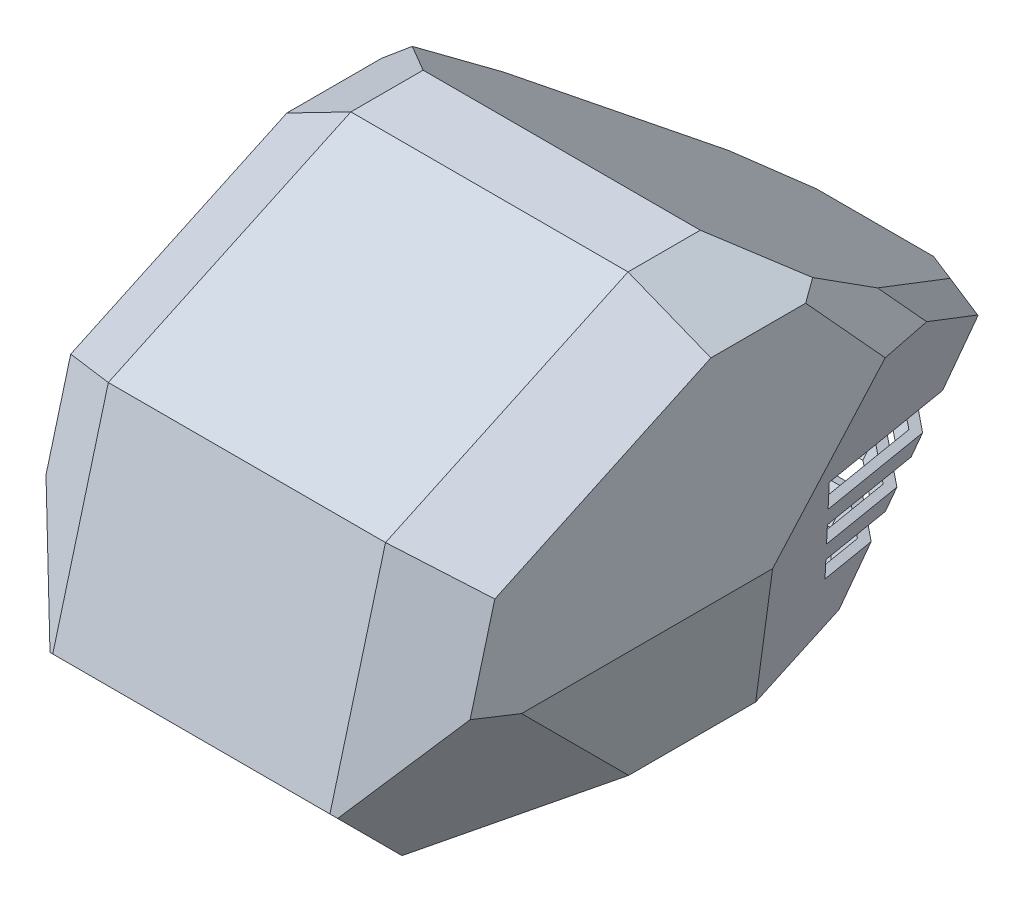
ISO-10303-21;
HEADER;
FILE_DESCRIPTION(('STEP AP214'),'2;1');
FILE_NAME('part.step','',(''),(''),'','','');
FILE_SCHEMA(('AUTOMOTIVE_DESIGN { 1 0 10303 214 1 1 1 1 }'));
ENDSEC;
DATA;
#1=APPLICATION_CONTEXT('core data for automotive mechanical design processes');
#2=APPLICATION_PROTOCOL_DEFINITION('international standard','automotive_design',2000,#1);
#3=PRODUCT_CONTEXT('',#1,'mechanical');
#4=PRODUCT('Part','Part','',(#3));
#5=PRODUCT_RELATED_PRODUCT_CATEGORY('part','',(#4));
#6=PRODUCT_DEFINITION_FORMATION('','',#4);
#7=PRODUCT_DEFINITION_CONTEXT('part definition',#1,'design');
#8=PRODUCT_DEFINITION('design','',#6,#7);
#9=PRODUCT_DEFINITION_SHAPE('','',#8);
#10=(LENGTH_UNIT() NAMED_UNIT(*) SI_UNIT(.MILLI.,.METRE.));
#11=(NAMED_UNIT(*) PLANE_ANGLE_UNIT() SI_UNIT($,.RADIAN.));
#12=(NAMED_UNIT(*) SI_UNIT($,.STERADIAN.) SOLID_ANGLE_UNIT());
#13=UNCERTAINTY_MEASURE_WITH_UNIT(LENGTH_MEASURE(1.E-05),#10,'distance_accuracy_value','');
#14=(GEOMETRIC_REPRESENTATION_CONTEXT(3) GLOBAL_UNCERTAINTY_ASSIGNED_CONTEXT((#13)) GLOBAL_UNIT_ASSIGNED_CONTEXT((#10,
#11,#12)) REPRESENTATION_CONTEXT('',''));
#15=CARTESIAN_POINT('',(0.,0.,0.));
#16=DIRECTION('',(0.,0.,1.));
#17=DIRECTION('',(1.,0.,0.));
#18=AXIS2_PLACEMENT_3D('',#15,#16,#17);
#19=CARTESIAN_POINT('',(450.,155.,-625.869692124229));
#20=DIRECTION('',(0.,0.500000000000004,0.866025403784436));
#21=DIRECTION('',(0.,-0.866025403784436,0.500000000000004));
#22=AXIS2_PLACEMENT_3D('',#19,#20,#21);
#23=PLANE('',#22);
#24=DIRECTION('',(0.0853889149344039,0.86286241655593,-0.498173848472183));
#25=VECTOR('',#24,1.);
#26=CARTESIAN_POINT('',(275.76417189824,167.931790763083,-633.335865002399));
#27=LINE('',#26,#25);
#28=CARTESIAN_POINT('',(277.718405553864,187.679491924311,-644.737205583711));
#29=VERTEX_POINT('',#28);
#30=CARTESIAN_POINT('',(274.97924142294,160.,-628.756443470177));
#31=VERTEX_POINT('',#30);
#32=EDGE_CURVE('E1136',#29,#31,#27,.F.);
#33=ORIENTED_EDGE('',*,*,#32,.F.);
#34=DIRECTION('',(-1.,0.,0.));
#35=VECTOR('',#34,1.);
#36=CARTESIAN_POINT('',(450.,187.679491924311,-644.737205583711));
#37=LINE('',#36,#35);
#38=CARTESIAN_POINT('',(172.281594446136,187.679491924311,-644.737205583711));
#39=VERTEX_POINT('',#38);
#40=EDGE_CURVE('E618',#29,#39,#37,.T.);
#41=ORIENTED_EDGE('',*,*,#40,.T.);
#42=DIRECTION('',(-0.085388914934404,0.86286241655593,-0.498173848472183));
#43=VECTOR('',#42,1.);
#44=CARTESIAN_POINT('',(177.516898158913,134.776292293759,-614.193529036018));
#45=LINE('',#44,#43);
#46=CARTESIAN_POINT('',(175.02075857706,160.,-628.756443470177));
#47=VERTEX_POINT('',#46);
#48=EDGE_CURVE('E1139',#47,#39,#45,.T.);
#49=ORIENTED_EDGE('',*,*,#48,.F.);
#50=DIRECTION('',(-1.,0.,0.));
#51=VECTOR('',#50,1.);
#52=CARTESIAN_POINT('',(450.,160.,-628.756443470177));
#53=LINE('',#52,#51);
#54=EDGE_CURVE('E1129',#31,#47,#53,.T.);
#55=ORIENTED_EDGE('',*,*,#54,.F.);
#56=EDGE_LOOP('',(#33,#41,#49,#55));
#57=FACE_BOUND('',#56,.T.);
#58=ADVANCED_FACE('F35',(#57),#23,.T.);
#59=CARTESIAN_POINT('',(170.063465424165,210.093878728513,-657.678157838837));
#60=VERTEX_POINT('',#59);
#61=CARTESIAN_POINT('',(168.288962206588,228.025388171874,-668.030919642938));
#62=VERTEX_POINT('',#61);
#63=EDGE_CURVE('E1142',#60,#62,#45,.T.);
#64=ORIENTED_EDGE('',*,*,#63,.F.);
#65=DIRECTION('',(1.,0.,0.));
#66=VECTOR('',#65,1.);
#67=CARTESIAN_POINT('',(450.,210.093878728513,-657.678157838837));
#68=LINE('',#67,#66);
#69=CARTESIAN_POINT('',(279.936534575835,210.093878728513,-657.678157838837));
#70=VERTEX_POINT('',#69);
#71=EDGE_CURVE('E50',#60,#70,#68,.T.);
#72=ORIENTED_EDGE('',*,*,#71,.T.);
#73=CARTESIAN_POINT('',(281.711037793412,228.025388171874,-668.030919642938));
#74=VERTEX_POINT('',#73);
#75=EDGE_CURVE('E1250',#74,#70,#27,.F.);
#76=ORIENTED_EDGE('',*,*,#75,.F.);
#77=DIRECTION('',(-1.,0.,0.));
#78=VECTOR('',#77,1.);
#79=CARTESIAN_POINT('',(450.,228.025388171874,-668.030919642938));
#80=LINE('',#79,#78);
#81=EDGE_CURVE('E659',#74,#62,#80,.T.);
#82=ORIENTED_EDGE('',*,*,#81,.T.);
#83=EDGE_LOOP('',(#64,#72,#76,#82));
#84=FACE_BOUND('',#83,.T.);
#85=ADVANCED_FACE('F1393',(#84),#23,.T.);
#86=CARTESIAN_POINT('',(14.7355729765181,152.588190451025,-247.19859842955));
#87=DIRECTION('',(-0.921243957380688,-0.258819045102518,-0.290382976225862));
#88=DIRECTION('',(-0.300626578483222,0.,0.953741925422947));
#89=AXIS2_PLACEMENT_3D('',#86,#87,#88);
#90=PLANE('',#89);
#91=DIRECTION('',(0.352911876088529,-0.24216573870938,-0.90377484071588));
#92=VECTOR('',#91,1.);
#93=CARTESIAN_POINT('',(-7.99181714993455,282.494787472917,-290.881705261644));
#94=LINE('',#93,#92);
#95=CARTESIAN_POINT('',(80.161076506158,222.00486900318,-516.633154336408));
#96=VERTEX_POINT('',#95);
#97=CARTESIAN_POINT('',(109.180861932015,202.091688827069,-590.95015449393));
#98=VERTEX_POINT('',#97);
#99=EDGE_CURVE('E611',#96,#98,#94,.T.);
#100=ORIENTED_EDGE('',*,*,#99,.F.);
#101=DIRECTION('',(0.348500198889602,-0.880782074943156,-0.320578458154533));
#102=VECTOR('',#101,1.);
#103=CARTESIAN_POINT('',(63.4209568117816,264.31301518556,-501.234248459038));
#104=LINE('',#103,#102);
#105=CARTESIAN_POINT('',(68.8136894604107,250.683690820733,-506.194916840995));
#106=VERTEX_POINT('',#105);
#107=EDGE_CURVE('E629',#106,#96,#104,.T.);
#108=ORIENTED_EDGE('',*,*,#107,.F.);
#109=DIRECTION('',(-0.352911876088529,0.24216573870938,0.90377484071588));
#110=VECTOR('',#109,1.);
#111=CARTESIAN_POINT('',(-12.1456347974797,306.237430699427,-298.865537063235));
#112=LINE('',#111,#110);
#113=CARTESIAN_POINT('',(106.962732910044,224.506075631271,-603.891106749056));
#114=VERTEX_POINT('',#113);
#115=EDGE_CURVE('E1236',#114,#106,#112,.T.);
#116=ORIENTED_EDGE('',*,*,#115,.F.);
#117=DIRECTION('',(0.085388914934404,-0.86286241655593,0.498173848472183));
#118=VECTOR('',#117,1.);
#119=CARTESIAN_POINT('',(126.762282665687,24.4299022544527,-488.377074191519));
#120=LINE('',#119,#118);
#121=CARTESIAN_POINT('',(105.188229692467,242.437585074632,-614.243868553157));
#122=VERTEX_POINT('',#121);
#123=EDGE_CURVE('E1463',#122,#114,#120,.T.);
#124=ORIENTED_EDGE('',*,*,#123,.F.);
#125=DIRECTION('',(0.352911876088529,-0.24216573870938,-0.90377484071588));
#126=VECTOR('',#125,1.);
#127=CARTESIAN_POINT('',(-15.4686889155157,325.231545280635,-305.252602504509));
#128=LINE('',#127,#126);
#129=CARTESIAN_POINT('',(59.7357798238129,273.626748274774,-497.844326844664));
#130=VERTEX_POINT('',#129);
#131=EDGE_CURVE('E657',#130,#122,#128,.T.);
#132=ORIENTED_EDGE('',*,*,#131,.F.);
#133=DIRECTION('',(0.348500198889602,-0.880782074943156,-0.320578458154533));
#134=VECTOR('',#133,1.);
#135=CARTESIAN_POINT('',(63.4209568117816,264.31301518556,-501.234248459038));
#136=LINE('',#135,#134);
#137=CARTESIAN_POINT('',(48.3883927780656,302.305570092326,-487.406089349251));
#138=VERTEX_POINT('',#137);
#139=EDGE_CURVE('E692',#138,#130,#136,.T.);
#140=ORIENTED_EDGE('',*,*,#139,.F.);
#141=DIRECTION('',(-0.352911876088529,0.24216573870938,0.903774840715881));
#142=VECTOR('',#141,1.);
#143=CARTESIAN_POINT('',(-19.6225065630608,348.974188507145,-313.2364343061));
#144=LINE('',#143,#142);
#145=CARTESIAN_POINT('',(102.970100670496,264.851971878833,-627.184820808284));
#146=VERTEX_POINT('',#145);
#147=EDGE_CURVE('E678',#146,#138,#144,.T.);
#148=ORIENTED_EDGE('',*,*,#147,.F.);
#149=CARTESIAN_POINT('',(101.195597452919,282.783481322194,-637.537582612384));
#150=VERTEX_POINT('',#149);
#151=EDGE_CURVE('E1033',#150,#146,#120,.T.);
#152=ORIENTED_EDGE('',*,*,#151,.F.);
#153=DIRECTION('',(0.352911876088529,-0.24216573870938,-0.90377484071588));
#154=VECTOR('',#153,1.);
#155=CARTESIAN_POINT('',(-22.9455606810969,367.968303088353,-319.623499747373));
#156=LINE('',#155,#154);
#157=CARTESIAN_POINT('',(39.3104831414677,325.248627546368,-479.05549935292));
#158=VERTEX_POINT('',#157);
#159=EDGE_CURVE('E708',#158,#150,#156,.T.);
#160=ORIENTED_EDGE('',*,*,#159,.F.);
#161=DIRECTION('',(0.348500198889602,-0.880782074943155,-0.320578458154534));
#162=VECTOR('',#161,1.);
#163=CARTESIAN_POINT('',(63.4209568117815,264.31301518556,-501.234248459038));
#164=LINE('',#163,#162);
#165=CARTESIAN_POINT('',(23.4241412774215,365.398978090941,-464.441966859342));
#166=VERTEX_POINT('',#165);
#167=EDGE_CURVE('E751',#166,#158,#164,.T.);
#168=ORIENTED_EDGE('',*,*,#167,.F.);
#169=DIRECTION('',(-0.352911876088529,0.24216573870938,0.903774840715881));
#170=VECTOR('',#169,1.);
#171=CARTESIAN_POINT('',(-28.7609053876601,401.208003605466,-330.800864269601));
#172=LINE('',#171,#170);
#173=CARTESIAN_POINT('',(98.0902168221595,314.163622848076,-655.654915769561));
#174=VERTEX_POINT('',#173);
#175=EDGE_CURVE('E730',#174,#166,#172,.T.);
#176=ORIENTED_EDGE('',*,*,#175,.F.);
#177=CARTESIAN_POINT('',(92.9100776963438,366.509379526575,-685.876752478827));
#178=VERTEX_POINT('',#177);
#179=EDGE_CURVE('E1030',#178,#174,#120,.T.);
#180=ORIENTED_EDGE('',*,*,#179,.F.);
#181=DIRECTION('',(0.384819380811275,-0.715365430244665,-0.583237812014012));
#182=VECTOR('',#181,1.);
#183=CARTESIAN_POINT('',(41.7656856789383,461.584970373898,-608.361573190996));
#184=LINE('',#183,#182);
#185=CARTESIAN_POINT('',(91.7487564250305,368.6682341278,-684.116637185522));
#186=VERTEX_POINT('',#185);
#187=EDGE_CURVE('E1035',#186,#178,#184,.T.);
#188=ORIENTED_EDGE('',*,*,#187,.F.);
#189=DIRECTION('',(0.386720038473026,-0.528950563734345,-0.755419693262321));
#190=VECTOR('',#189,1.);
#191=CARTESIAN_POINT('',(-3.20778552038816,498.548538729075,-498.628339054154));
#192=LINE('',#191,#190);
#193=CARTESIAN_POINT('',(33.6090975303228,448.190892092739,-570.546511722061));
#194=VERTEX_POINT('',#193);
#195=EDGE_CURVE('E1037',#194,#186,#192,.T.);
#196=ORIENTED_EDGE('',*,*,#195,.F.);
#197=DIRECTION('',(-0.345394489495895,0.200906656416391,0.916700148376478));
#198=VECTOR('',#197,1.);
#199=CARTESIAN_POINT('',(-50.5094304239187,497.120370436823,-347.290294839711));
#200=LINE('',#199,#198);
#201=CARTESIAN_POINT('',(10.,461.923667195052,-507.886382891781));
#202=VERTEX_POINT('',#201);
#203=EDGE_CURVE('E1039',#202,#194,#200,.F.);
#204=ORIENTED_EDGE('',*,*,#203,.F.);
#205=DIRECTION('',(0.,-0.746513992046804,0.665369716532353));
#206=VECTOR('',#205,1.);
#207=CARTESIAN_POINT('',(10.,-47.7697342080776,-53.5954283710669));
#208=LINE('',#207,#206);
#209=CARTESIAN_POINT('',(10.,330.349302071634,-390.613834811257));
#210=VERTEX_POINT('',#209);
#211=EDGE_CURVE('E1050',#202,#210,#208,.T.);
#212=ORIENTED_EDGE('',*,*,#211,.T.);
#213=DIRECTION('',(-0.332001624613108,0.91216696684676,0.240263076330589));
#214=VECTOR('',#213,1.);
#215=CARTESIAN_POINT('',(52.9154084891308,212.440186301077,-421.670875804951));
#216=LINE('',#215,#214);
#217=CARTESIAN_POINT('',(72.0020753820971,160.,-435.48352298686));
#218=VERTEX_POINT('',#217);
#219=EDGE_CURVE('E1027',#218,#210,#216,.T.);
#220=ORIENTED_EDGE('',*,*,#219,.F.);
#221=DIRECTION('',(0.300626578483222,0.,-0.953741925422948));
#222=VECTOR('',#221,1.);
#223=CARTESIAN_POINT('',(12.8414525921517,160.,-247.795639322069));
#224=LINE('',#223,#222);
#225=CARTESIAN_POINT('',(113.346257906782,160.,-566.648506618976));
#226=VERTEX_POINT('',#225);
#227=EDGE_CURVE('E1146',#218,#226,#224,.T.);
#228=ORIENTED_EDGE('',*,*,#227,.T.);
#229=EDGE_CURVE('E1034',#98,#226,#120,.T.);
#230=ORIENTED_EDGE('',*,*,#229,.F.);
#231=EDGE_LOOP('',(#100,#108,#116,#124,#132,#140,#148,#152,#160,#168,#176,#180,#188,#196,#204,
#212,#220,#228,#230));
#232=FACE_BOUND('',#231,.T.);
#233=ADVANCED_FACE('F1306',(#232),#90,.F.);
#234=CARTESIAN_POINT('',(475.93377988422,152.588190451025,-118.174521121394));
#235=DIRECTION('',(-0.921243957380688,0.258819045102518,0.290382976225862));
#236=DIRECTION('',(0.300626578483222,0.,0.953741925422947));
#237=AXIS2_PLACEMENT_3D('',#234,#235,#236);
#238=PLANE('',#237);
#239=DIRECTION('',(-0.352911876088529,-0.24216573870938,-0.90377484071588));
#240=VECTOR('',#239,1.);
#241=CARTESIAN_POINT('',(504.209654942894,314.209154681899,-172.522075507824));
#242=LINE('',#241,#240);
#243=CARTESIAN_POINT('',(340.819138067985,202.091688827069,-590.95015449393));
#244=VERTEX_POINT('',#243);
#245=CARTESIAN_POINT('',(369.838923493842,222.00486900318,-516.633154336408));
#246=VERTEX_POINT('',#245);
#247=EDGE_CURVE('E623',#244,#246,#242,.F.);
#248=ORIENTED_EDGE('',*,*,#247,.F.);
#249=DIRECTION('',(0.0853889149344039,0.86286241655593,-0.498173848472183));
#250=VECTOR('',#249,1.);
#251=CARTESIAN_POINT('',(318.045754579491,-28.0353332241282,-458.086256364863));
#252=LINE('',#251,#250);
#253=CARTESIAN_POINT('',(336.653742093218,160.,-566.648506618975));
#254=VERTEX_POINT('',#253);
#255=EDGE_CURVE('E1014',#254,#244,#252,.T.);
#256=ORIENTED_EDGE('',*,*,#255,.F.);
#257=DIRECTION('',(-0.300626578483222,0.,-0.953741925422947));
#258=VECTOR('',#257,1.);
#259=CARTESIAN_POINT('',(477.827900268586,160.,-118.771562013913));
#260=LINE('',#259,#258);
#261=CARTESIAN_POINT('',(377.997924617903,160.,-435.483522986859));
#262=VERTEX_POINT('',#261);
#263=EDGE_CURVE('E1161',#254,#262,#260,.F.);
#264=ORIENTED_EDGE('',*,*,#263,.T.);
#265=DIRECTION('',(-0.332001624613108,-0.91216696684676,-0.240263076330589));
#266=VECTOR('',#265,1.);
#267=CARTESIAN_POINT('',(411.859332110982,253.033452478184,-410.978685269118));
#268=LINE('',#267,#266);
#269=CARTESIAN_POINT('',(440.,330.349302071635,-390.613834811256));
#270=VERTEX_POINT('',#269);
#271=EDGE_CURVE('E1019',#270,#262,#268,.T.);
#272=ORIENTED_EDGE('',*,*,#271,.F.);
#273=DIRECTION('',(0.,-0.746513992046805,0.665369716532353));
#274=VECTOR('',#273,1.);
#275=CARTESIAN_POINT('',(440.,95.9632985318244,-181.705026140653));
#276=LINE('',#275,#274);
#277=CARTESIAN_POINT('',(440.,461.923667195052,-507.886382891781));
#278=VERTEX_POINT('',#277);
#279=EDGE_CURVE('E1071',#270,#278,#276,.F.);
#280=ORIENTED_EDGE('',*,*,#279,.T.);
#281=DIRECTION('',(0.345394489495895,0.200906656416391,0.916700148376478));
#282=VECTOR('',#281,1.);
#283=CARTESIAN_POINT('',(546.213190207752,523.705014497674,-225.989450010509));
#284=LINE('',#283,#282);
#285=CARTESIAN_POINT('',(416.390902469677,448.190892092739,-570.546511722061));
#286=VERTEX_POINT('',#285);
#287=EDGE_CURVE('E1022',#286,#278,#284,.T.);
#288=ORIENTED_EDGE('',*,*,#287,.F.);
#289=DIRECTION('',(0.386720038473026,0.528950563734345,0.755419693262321));
#290=VECTOR('',#289,1.);
#291=CARTESIAN_POINT('',(496.98255354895,558.423088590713,-413.118620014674));
#292=LINE('',#291,#290);
#293=CARTESIAN_POINT('',(358.25124357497,368.668234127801,-684.116637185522));
#294=VERTEX_POINT('',#293);
#295=EDGE_CURVE('E1024',#294,#286,#292,.T.);
#296=ORIENTED_EDGE('',*,*,#295,.F.);
#297=DIRECTION('',(0.384819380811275,0.715365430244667,0.58323781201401));
#298=VECTOR('',#297,1.);
#299=CARTESIAN_POINT('',(443.215194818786,526.613172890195,-555.344045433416));
#300=LINE('',#299,#298);
#301=CARTESIAN_POINT('',(357.089922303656,366.509379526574,-685.876752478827));
#302=VERTEX_POINT('',#301);
#303=EDGE_CURVE('E1012',#302,#294,#300,.T.);
#304=ORIENTED_EDGE('',*,*,#303,.F.);
#305=CARTESIAN_POINT('',(351.90978317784,314.163622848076,-655.654915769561));
#306=VERTEX_POINT('',#305);
#307=EDGE_CURVE('E1018',#306,#302,#252,.T.);
#308=ORIENTED_EDGE('',*,*,#307,.F.);
#309=DIRECTION('',(0.352911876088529,0.24216573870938,0.90377484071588));
#310=VECTOR('',#309,1.);
#311=CARTESIAN_POINT('',(524.978743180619,432.922370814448,-212.441234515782));
#312=LINE('',#311,#310);
#313=CARTESIAN_POINT('',(426.575858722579,365.398978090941,-464.441966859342));
#314=VERTEX_POINT('',#313);
#315=EDGE_CURVE('E737',#314,#306,#312,.F.);
#316=ORIENTED_EDGE('',*,*,#315,.F.);
#317=DIRECTION('',(-0.348500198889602,-0.880782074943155,-0.320578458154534));
#318=VECTOR('',#317,1.);
#319=CARTESIAN_POINT('',(405.933216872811,313.227791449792,-483.430725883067));
#320=LINE('',#319,#318);
#321=CARTESIAN_POINT('',(410.689516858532,325.248627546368,-479.055499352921));
#322=VERTEX_POINT('',#321);
#323=EDGE_CURVE('E1168',#322,#314,#320,.F.);
#324=ORIENTED_EDGE('',*,*,#323,.F.);
#325=DIRECTION('',(-0.352911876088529,-0.24216573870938,-0.90377484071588));
#326=VECTOR('',#325,1.);
#327=CARTESIAN_POINT('',(519.163398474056,399.682670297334,-201.263869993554));
#328=LINE('',#327,#326);
#329=CARTESIAN_POINT('',(348.804402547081,282.783481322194,-637.537582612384));
#330=VERTEX_POINT('',#329);
#331=EDGE_CURVE('E716',#330,#322,#328,.F.);
#332=ORIENTED_EDGE('',*,*,#331,.F.);
#333=CARTESIAN_POINT('',(347.029899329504,264.851971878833,-627.184820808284));
#334=VERTEX_POINT('',#333);
#335=EDGE_CURVE('E1255',#334,#330,#252,.T.);
#336=ORIENTED_EDGE('',*,*,#335,.F.);
#337=DIRECTION('',(0.352911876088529,0.24216573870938,0.903774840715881));
#338=VECTOR('',#337,1.);
#339=CARTESIAN_POINT('',(515.84034435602,380.688555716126,-194.87680455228));
#340=LINE('',#339,#338);
#341=CARTESIAN_POINT('',(401.611607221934,302.305570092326,-487.406089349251));
#342=VERTEX_POINT('',#341);
#343=EDGE_CURVE('E685',#342,#334,#340,.F.);
#344=ORIENTED_EDGE('',*,*,#343,.F.);
#345=DIRECTION('',(-0.348500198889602,-0.880782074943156,-0.320578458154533));
#346=VECTOR('',#345,1.);
#347=CARTESIAN_POINT('',(405.93321687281,313.227791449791,-483.430725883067));
#348=LINE('',#347,#346);
#349=CARTESIAN_POINT('',(390.264220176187,273.626748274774,-497.844326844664));
#350=VERTEX_POINT('',#349);
#351=EDGE_CURVE('E690',#350,#342,#348,.F.);
#352=ORIENTED_EDGE('',*,*,#351,.F.);
#353=DIRECTION('',(-0.352911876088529,-0.24216573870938,-0.90377484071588));
#354=VECTOR('',#353,1.);
#355=CARTESIAN_POINT('',(511.686526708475,356.945912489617,-186.892972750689));
#356=LINE('',#355,#354);
#357=CARTESIAN_POINT('',(344.811770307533,242.437585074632,-614.243868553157));
#358=VERTEX_POINT('',#357);
#359=EDGE_CURVE('E665',#358,#350,#356,.F.);
#360=ORIENTED_EDGE('',*,*,#359,.F.);
#361=CARTESIAN_POINT('',(343.037267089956,224.506075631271,-603.891106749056));
#362=VERTEX_POINT('',#361);
#363=EDGE_CURVE('E1017',#362,#358,#252,.T.);
#364=ORIENTED_EDGE('',*,*,#363,.F.);
#365=DIRECTION('',(0.352911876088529,0.24216573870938,0.90377484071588));
#366=VECTOR('',#365,1.);
#367=CARTESIAN_POINT('',(508.363472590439,337.951797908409,-180.505907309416));
#368=LINE('',#367,#366);
#369=CARTESIAN_POINT('',(381.186310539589,250.683690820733,-506.194916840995));
#370=VERTEX_POINT('',#369);
#371=EDGE_CURVE('E1241',#370,#362,#368,.F.);
#372=ORIENTED_EDGE('',*,*,#371,.F.);
#373=DIRECTION('',(-0.348500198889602,-0.880782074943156,-0.320578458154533));
#374=VECTOR('',#373,1.);
#375=CARTESIAN_POINT('',(405.93321687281,313.227791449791,-483.430725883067));
#376=LINE('',#375,#374);
#377=EDGE_CURVE('E595',#246,#370,#376,.F.);
#378=ORIENTED_EDGE('',*,*,#377,.F.);
#379=EDGE_LOOP('',(#248,#256,#264,#272,#280,#288,#296,#304,#308,#316,#324,#332,#336,#344,#352,
#360,#364,#372,#378));
#380=FACE_BOUND('',#379,.T.);
#381=ADVANCED_FACE('F1253',(#380),#238,.T.);
#382=CARTESIAN_POINT('',(272.986181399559,166.968195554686,-635.481019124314));
#383=DIRECTION('',(-0.640439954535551,0.430555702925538,0.635970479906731));
#384=DIRECTION('',(-0.0853889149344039,-0.86286241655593,0.498173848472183));
#385=AXIS2_PLACEMENT_3D('',#382,#383,#384);
#386=PLANE('',#385);
#387=DIRECTION('',(-0.749794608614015,-0.171252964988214,-0.639124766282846));
#388=VECTOR('',#387,1.);
#389=CARTESIAN_POINT('',(276.834240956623,187.477548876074,-645.490867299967));
#390=LINE('',#389,#388);
#391=EDGE_CURVE('E621',#29,#244,#390,.F.);
#392=ORIENTED_EDGE('',*,*,#391,.F.);
#393=ORIENTED_EDGE('',*,*,#32,.T.);
#394=DIRECTION('',(-0.704626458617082,0.,-0.709578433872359));
#395=VECTOR('',#394,1.);
#396=CARTESIAN_POINT('',(270.627484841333,160.,-633.138783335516));
#397=LINE('',#396,#395);
#398=EDGE_CURVE('E960',#31,#254,#397,.F.);
#399=ORIENTED_EDGE('',*,*,#398,.T.);
#400=ORIENTED_EDGE('',*,*,#255,.T.);
#401=EDGE_LOOP('',(#392,#393,#399,#400));
#402=FACE_BOUND('',#401,.T.);
#403=ADVANCED_FACE('F1336',(#402),#386,.T.);
#404=DIRECTION('',(0.749794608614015,0.171252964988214,0.639124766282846));
#405=VECTOR('',#404,1.);
#406=CARTESIAN_POINT('',(281.128709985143,210.366171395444,-656.661947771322));
#407=LINE('',#406,#405);
#408=EDGE_CURVE('E1239',#362,#70,#407,.F.);
#409=ORIENTED_EDGE('',*,*,#408,.F.);
#410=ORIENTED_EDGE('',*,*,#363,.T.);
#411=DIRECTION('',(-0.749794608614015,-0.171252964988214,-0.639124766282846));
#412=VECTOR('',#411,1.);
#413=CARTESIAN_POINT('',(284.564285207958,228.677069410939,-665.598812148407));
#414=LINE('',#413,#412);
#415=EDGE_CURVE('E662',#74,#358,#414,.F.);
#416=ORIENTED_EDGE('',*,*,#415,.F.);
#417=ORIENTED_EDGE('',*,*,#75,.T.);
#418=EDGE_LOOP('',(#409,#410,#416,#417));
#419=FACE_BOUND('',#418,.T.);
#420=ADVANCED_FACE('F1247',(#419),#386,.T.);
#421=CARTESIAN_POINT('',(180.294888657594,133.812697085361,-616.338683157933));
#422=DIRECTION('',(-0.640439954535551,-0.430555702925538,-0.635970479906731));
#423=DIRECTION('',(0.085388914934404,-0.86286241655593,0.498173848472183));
#424=AXIS2_PLACEMENT_3D('',#421,#422,#423);
#425=PLANE('',#424);
#426=DIRECTION('',(0.749794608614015,-0.171252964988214,-0.639124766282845));
#427=VECTOR('',#426,1.);
#428=CARTESIAN_POINT('',(170.094424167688,188.179041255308,-642.872862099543));
#429=LINE('',#428,#427);
#430=EDGE_CURVE('E608',#98,#39,#429,.T.);
#431=ORIENTED_EDGE('',*,*,#430,.F.);
#432=ORIENTED_EDGE('',*,*,#229,.T.);
#433=DIRECTION('',(0.704626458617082,0.,-0.709578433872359));
#434=VECTOR('',#433,1.);
#435=CARTESIAN_POINT('',(171.430628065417,160.,-625.141082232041));
#436=LINE('',#435,#434);
#437=EDGE_CURVE('E1144',#226,#47,#436,.T.);
#438=ORIENTED_EDGE('',*,*,#437,.T.);
#439=ORIENTED_EDGE('',*,*,#48,.T.);
#440=EDGE_LOOP('',(#431,#432,#438,#439));
#441=FACE_BOUND('',#440,.T.);
#442=ADVANCED_FACE('F1467',(#441),#425,.F.);
#443=DIRECTION('',(-0.749794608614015,0.171252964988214,0.639124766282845));
#444=VECTOR('',#443,1.);
#445=CARTESIAN_POINT('',(165.799955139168,211.067663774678,-654.043942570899));
#446=LINE('',#445,#444);
#447=EDGE_CURVE('E588',#60,#114,#446,.T.);
#448=ORIENTED_EDGE('',*,*,#447,.F.);
#449=ORIENTED_EDGE('',*,*,#63,.T.);
#450=DIRECTION('',(0.749794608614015,-0.171252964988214,-0.639124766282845));
#451=VECTOR('',#450,1.);
#452=CARTESIAN_POINT('',(162.364379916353,229.378561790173,-662.980806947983));
#453=LINE('',#452,#451);
#454=EDGE_CURVE('E654',#122,#62,#453,.T.);
#455=ORIENTED_EDGE('',*,*,#454,.F.);
#456=ORIENTED_EDGE('',*,*,#123,.T.);
#457=EDGE_LOOP('',(#448,#449,#455,#456));
#458=FACE_BOUND('',#457,.T.);
#459=ADVANCED_FACE('F1429',(#458),#425,.F.);
#460=CARTESIAN_POINT('',(450.,150.,-634.529946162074));
#461=DIRECTION('',(0.,0.500000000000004,0.866025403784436));
#462=DIRECTION('',(0.,-0.866025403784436,0.500000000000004));
#463=AXIS2_PLACEMENT_3D('',#460,#461,#462);
#464=PLANE('',#463);
#465=DIRECTION('',(-1.,0.,0.));
#466=VECTOR('',#465,1.);
#467=CARTESIAN_POINT('',(450.,185.,-654.737205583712));
#468=LINE('',#467,#466);
#469=CARTESIAN_POINT('',(281.601087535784,185.,-654.737205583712));
#470=VERTEX_POINT('',#469);
#471=CARTESIAN_POINT('',(168.398912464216,185.,-654.737205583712));
#472=VERTEX_POINT('',#471);
#473=EDGE_CURVE('E1190',#470,#472,#468,.T.);
#474=ORIENTED_EDGE('',*,*,#473,.F.);
#475=DIRECTION('',(-0.0853889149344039,-0.862862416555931,0.498173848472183));
#476=VECTOR('',#475,1.);
#477=CARTESIAN_POINT('',(278.466795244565,153.327703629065,-636.451196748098));
#478=LINE('',#477,#476);
#479=CARTESIAN_POINT('',(278.137485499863,150.,-634.529946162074));
#480=VERTEX_POINT('',#479);
#481=EDGE_CURVE('E878',#470,#480,#478,.T.);
#482=ORIENTED_EDGE('',*,*,#481,.T.);
#483=DIRECTION('',(-1.,0.,0.));
#484=VECTOR('',#483,1.);
#485=CARTESIAN_POINT('',(450.,150.,-634.529946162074));
#486=LINE('',#485,#484);
#487=CARTESIAN_POINT('',(171.862514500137,150.,-634.529946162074));
#488=VERTEX_POINT('',#487);
#489=EDGE_CURVE('E776',#480,#488,#486,.T.);
#490=ORIENTED_EDGE('',*,*,#489,.T.);
#491=DIRECTION('',(-0.0853889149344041,0.862862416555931,-0.498173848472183));
#492=VECTOR('',#491,1.);
#493=CARTESIAN_POINT('',(151.741193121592,353.327703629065,-751.921250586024));
#494=LINE('',#493,#492);
#495=EDGE_CURVE('E875',#488,#472,#494,.T.);
#496=ORIENTED_EDGE('',*,*,#495,.T.);
#497=EDGE_LOOP('',(#474,#482,#490,#496));
#498=FACE_BOUND('',#497,.T.);
#499=ADVANCED_FACE('F1189',(#498),#464,.F.);
#500=DIRECTION('',(-1.,0.,0.));
#501=VECTOR('',#500,1.);
#502=CARTESIAN_POINT('',(450.,207.414386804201,-667.678157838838));
#503=LINE('',#502,#501);
#504=CARTESIAN_POINT('',(283.819216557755,207.414386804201,-667.678157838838));
#505=VERTEX_POINT('',#504);
#506=CARTESIAN_POINT('',(166.180783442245,207.414386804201,-667.678157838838));
#507=VERTEX_POINT('',#506);
#508=EDGE_CURVE('E596',#505,#507,#503,.T.);
#509=ORIENTED_EDGE('',*,*,#508,.T.);
#510=CARTESIAN_POINT('',(164.406280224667,225.345896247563,-678.030919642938));
#511=VERTEX_POINT('',#510);
#512=EDGE_CURVE('E879',#507,#511,#494,.T.);
#513=ORIENTED_EDGE('',*,*,#512,.T.);
#514=DIRECTION('',(-1.,0.,0.));
#515=VECTOR('',#514,1.);
#516=CARTESIAN_POINT('',(450.,225.345896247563,-678.030919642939));
#517=LINE('',#516,#515);
#518=CARTESIAN_POINT('',(285.593719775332,225.345896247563,-678.030919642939));
#519=VERTEX_POINT('',#518);
#520=EDGE_CURVE('E634',#519,#511,#517,.T.);
#521=ORIENTED_EDGE('',*,*,#520,.F.);
#522=EDGE_CURVE('E1220',#519,#505,#478,.T.);
#523=ORIENTED_EDGE('',*,*,#522,.T.);
#524=EDGE_LOOP('',(#509,#513,#521,#523));
#525=FACE_BOUND('',#524,.T.);
#526=ADVANCED_FACE('F1226',(#525),#464,.F.);
#527=CARTESIAN_POINT('',(5.52313340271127,150.,-250.102428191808));
#528=DIRECTION('',(-0.921243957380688,-0.258819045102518,-0.290382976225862));
#529=DIRECTION('',(-0.300626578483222,0.,0.953741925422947));
#530=AXIS2_PLACEMENT_3D('',#527,#528,#529);
#531=PLANE('',#530);
#532=DIRECTION('',(0.348500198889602,-0.880782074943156,-0.320578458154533));
#533=VECTOR('',#532,1.);
#534=CARTESIAN_POINT('',(53.884420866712,260.981077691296,-502.446974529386));
#535=LINE('',#534,#533);
#536=CARTESIAN_POINT('',(57.9588014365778,250.683690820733,-506.194916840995));
#537=VERTEX_POINT('',#536);
#538=CARTESIAN_POINT('',(69.3061884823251,222.00486900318,-516.633154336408));
#539=VERTEX_POINT('',#538);
#540=EDGE_CURVE('E625',#537,#539,#535,.T.);
#541=ORIENTED_EDGE('',*,*,#540,.T.);
#542=DIRECTION('',(0.352911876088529,-0.24216573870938,-0.90377484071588));
#543=VECTOR('',#542,1.);
#544=CARTESIAN_POINT('',(-17.4947636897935,281.56709438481,-294.343903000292));
#545=LINE('',#544,#543);
#546=CARTESIAN_POINT('',(100.700497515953,200.462306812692,-597.031090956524));
#547=VERTEX_POINT('',#546);
#548=EDGE_CURVE('E613',#539,#547,#545,.T.);
#549=ORIENTED_EDGE('',*,*,#548,.T.);
#550=DIRECTION('',(0.0853889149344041,-0.86286241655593,0.498173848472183));
#551=VECTOR('',#550,1.);
#552=CARTESIAN_POINT('',(103.012909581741,177.095181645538,-583.54007495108));
#553=LINE('',#552,#551);
#554=CARTESIAN_POINT('',(105.694250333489,150.,-567.896664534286));
#555=VERTEX_POINT('',#554);
#556=EDGE_CURVE('E890',#547,#555,#553,.T.);
#557=ORIENTED_EDGE('',*,*,#556,.T.);
#558=DIRECTION('',(0.300626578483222,0.,-0.953741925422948));
#559=VECTOR('',#558,1.);
#560=CARTESIAN_POINT('',(123.380967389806,150.,-624.00801591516));
#561=LINE('',#560,#559);
#562=CARTESIAN_POINT('',(65.,150.,-438.793599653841));
#563=VERTEX_POINT('',#562);
#564=EDGE_CURVE('E781',#563,#555,#561,.T.);
#565=ORIENTED_EDGE('',*,*,#564,.F.);
#566=DIRECTION('',(-0.332001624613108,0.91216696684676,0.240263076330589));
#567=VECTOR('',#566,1.);
#568=CARTESIAN_POINT('',(43.3926909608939,209.365593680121,-423.15681309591));
#569=LINE('',#568,#567);
#570=CARTESIAN_POINT('',(0.,328.58603226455,-391.754372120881));
#571=VERTEX_POINT('',#570);
#572=EDGE_CURVE('E794',#563,#571,#569,.T.);
#573=ORIENTED_EDGE('',*,*,#572,.T.);
#574=DIRECTION('',(0.,-0.746513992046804,0.665369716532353));
#575=VECTOR('',#574,1.);
#576=CARTESIAN_POINT('',(0.,-49.1168772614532,-55.1068604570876));
#577=LINE('',#576,#575);
#578=CARTESIAN_POINT('',(0.,462.611350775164,-511.211460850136));
#579=VERTEX_POINT('',#578);
#580=EDGE_CURVE('E784',#579,#571,#577,.T.);
#581=ORIENTED_EDGE('',*,*,#580,.F.);
#582=DIRECTION('',(-0.345394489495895,0.200906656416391,0.916700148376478));
#583=VECTOR('',#582,1.);
#584=CARTESIAN_POINT('',(-60.3215338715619,497.69875966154,-351.114062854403));
#585=LINE('',#584,#583);
#586=CARTESIAN_POINT('',(26.6204674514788,447.126943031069,-581.863967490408));
#587=VERTEX_POINT('',#586);
#588=EDGE_CURVE('E941',#579,#587,#585,.F.);
#589=ORIENTED_EDGE('',*,*,#588,.T.);
#590=DIRECTION('',(0.386720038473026,-0.528950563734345,-0.755419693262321));
#591=VECTOR('',#590,1.);
#592=CARTESIAN_POINT('',(83.3224616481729,369.570703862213,-692.625755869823));
#593=LINE('',#592,#591);
#594=CARTESIAN_POINT('',(83.2500068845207,369.669806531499,-692.484222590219));
#595=VERTEX_POINT('',#594);
#596=EDGE_CURVE('E918',#587,#595,#593,.T.);
#597=ORIENTED_EDGE('',*,*,#596,.T.);
#598=DIRECTION('',(0.384819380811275,-0.715365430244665,-0.583237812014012));
#599=VECTOR('',#598,1.);
#600=CARTESIAN_POINT('',(32.9231699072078,463.225591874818,-616.208141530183));
#601=LINE('',#600,#599);
#602=CARTESIAN_POINT('',(84.1148044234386,368.062178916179,-693.79492223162));
#603=VERTEX_POINT('',#602);
#604=EDGE_CURVE('E920',#595,#603,#601,.T.);
#605=ORIENTED_EDGE('',*,*,#604,.T.);
#606=CARTESIAN_POINT('',(89.6098524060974,312.534240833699,-661.735852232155));
#607=VERTEX_POINT('',#606);
#608=EDGE_CURVE('E892',#603,#607,#553,.T.);
#609=ORIENTED_EDGE('',*,*,#608,.T.);
#610=DIRECTION('',(-0.352911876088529,0.24216573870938,0.903774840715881));
#611=VECTOR('',#610,1.);
#612=CARTESIAN_POINT('',(-38.263851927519,400.280310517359,-334.263062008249));
#613=LINE('',#612,#611);
#614=CARTESIAN_POINT('',(12.5692532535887,365.398978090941,-464.441966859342));
#615=VERTEX_POINT('',#614);
#616=EDGE_CURVE('E742',#607,#615,#613,.T.);
#617=ORIENTED_EDGE('',*,*,#616,.T.);
#618=DIRECTION('',(0.348500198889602,-0.880782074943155,-0.320578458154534));
#619=VECTOR('',#618,1.);
#620=CARTESIAN_POINT('',(53.8844208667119,260.981077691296,-502.446974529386));
#621=LINE('',#620,#619);
#622=CARTESIAN_POINT('',(28.4555951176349,325.248627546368,-479.05549935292));
#623=VERTEX_POINT('',#622);
#624=EDGE_CURVE('E756',#615,#623,#621,.T.);
#625=ORIENTED_EDGE('',*,*,#624,.T.);
#626=DIRECTION('',(0.352911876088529,-0.24216573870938,-0.90377484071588));
#627=VECTOR('',#626,1.);
#628=CARTESIAN_POINT('',(-32.4485072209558,367.040610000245,-323.085697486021));
#629=LINE('',#628,#627);
#630=CARTESIAN_POINT('',(92.7152330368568,281.154099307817,-643.618519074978));
#631=VERTEX_POINT('',#630);
#632=EDGE_CURVE('E721',#623,#631,#629,.T.);
#633=ORIENTED_EDGE('',*,*,#632,.T.);
#634=CARTESIAN_POINT('',(94.4897362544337,263.222589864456,-633.265757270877));
#635=VERTEX_POINT('',#634);
#636=EDGE_CURVE('E896',#631,#635,#553,.T.);
#637=ORIENTED_EDGE('',*,*,#636,.T.);
#638=DIRECTION('',(-0.352911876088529,0.24216573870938,0.903774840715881));
#639=VECTOR('',#638,1.);
#640=CARTESIAN_POINT('',(-29.1254531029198,348.046495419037,-316.698632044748));
#641=LINE('',#640,#639);
#642=CARTESIAN_POINT('',(37.5335047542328,302.305570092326,-487.406089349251));
#643=VERTEX_POINT('',#642);
#644=EDGE_CURVE('E667',#635,#643,#641,.T.);
#645=ORIENTED_EDGE('',*,*,#644,.T.);
#646=DIRECTION('',(0.348500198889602,-0.880782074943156,-0.320578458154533));
#647=VECTOR('',#646,1.);
#648=CARTESIAN_POINT('',(53.884420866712,260.981077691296,-502.446974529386));
#649=LINE('',#648,#647);
#650=CARTESIAN_POINT('',(48.88089179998,273.626748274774,-497.844326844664));
#651=VERTEX_POINT('',#650);
#652=EDGE_CURVE('E687',#643,#651,#649,.T.);
#653=ORIENTED_EDGE('',*,*,#652,.T.);
#654=DIRECTION('',(0.352911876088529,-0.24216573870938,-0.90377484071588));
#655=VECTOR('',#654,1.);
#656=CARTESIAN_POINT('',(-24.9716354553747,324.303852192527,-308.714800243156));
#657=LINE('',#656,#655);
#658=CARTESIAN_POINT('',(96.7078652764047,240.808203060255,-620.324805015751));
#659=VERTEX_POINT('',#658);
#660=EDGE_CURVE('E645',#651,#659,#657,.T.);
#661=ORIENTED_EDGE('',*,*,#660,.T.);
#662=CARTESIAN_POINT('',(98.4823684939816,222.876693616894,-609.97204321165));
#663=VERTEX_POINT('',#662);
#664=EDGE_CURVE('E1203',#659,#663,#553,.T.);
#665=ORIENTED_EDGE('',*,*,#664,.T.);
#666=DIRECTION('',(-0.352911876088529,0.24216573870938,0.90377484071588));
#667=VECTOR('',#666,1.);
#668=CARTESIAN_POINT('',(-21.6485813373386,305.30973761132,-302.327734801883));
#669=LINE('',#668,#667);
#670=EDGE_CURVE('E57',#663,#537,#669,.T.);
#671=ORIENTED_EDGE('',*,*,#670,.T.);
#672=EDGE_LOOP('',(#541,#549,#557,#565,#573,#581,#589,#597,#605,#609,#617,#625,#633,#637,#645,
#653,#661,#665,#671));
#673=FACE_BOUND('',#672,.T.);
#674=ADVANCED_FACE('F1200',(#673),#531,.T.);
#675=CARTESIAN_POINT('',(485.146219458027,150.,-121.078350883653));
#676=DIRECTION('',(-0.921243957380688,0.258819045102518,0.290382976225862));
#677=DIRECTION('',(0.300626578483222,0.,0.953741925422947));
#678=AXIS2_PLACEMENT_3D('',#675,#676,#677);
#679=PLANE('',#678);
#680=DIRECTION('',(-0.0853889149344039,-0.86286241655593,0.498173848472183));
#681=VECTOR('',#680,1.);
#682=CARTESIAN_POINT('',(366.779102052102,377.095181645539,-699.010128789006));
#683=LINE('',#682,#681);
#684=CARTESIAN_POINT('',(344.305749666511,150.,-567.896664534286));
#685=VERTEX_POINT('',#684);
#686=CARTESIAN_POINT('',(349.299502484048,200.462306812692,-597.031090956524));
#687=VERTEX_POINT('',#686);
#688=EDGE_CURVE('E605',#685,#687,#683,.F.);
#689=ORIENTED_EDGE('',*,*,#688,.T.);
#690=DIRECTION('',(-0.352911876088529,-0.24216573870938,-0.90377484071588));
#691=VECTOR('',#690,1.);
#692=CARTESIAN_POINT('',(513.712601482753,313.281461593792,-175.984273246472));
#693=LINE('',#692,#691);
#694=CARTESIAN_POINT('',(380.693811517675,222.00486900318,-516.633154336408));
#695=VERTEX_POINT('',#694);
#696=EDGE_CURVE('E602',#687,#695,#693,.F.);
#697=ORIENTED_EDGE('',*,*,#696,.T.);
#698=DIRECTION('',(-0.348500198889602,-0.880782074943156,-0.320578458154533));
#699=VECTOR('',#698,1.);
#700=CARTESIAN_POINT('',(415.46975281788,309.895853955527,-484.643451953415));
#701=LINE('',#700,#699);
#702=CARTESIAN_POINT('',(392.041198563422,250.683690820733,-506.194916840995));
#703=VERTEX_POINT('',#702);
#704=EDGE_CURVE('E12',#695,#703,#701,.F.);
#705=ORIENTED_EDGE('',*,*,#704,.T.);
#706=DIRECTION('',(0.352911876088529,0.24216573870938,0.90377484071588));
#707=VECTOR('',#706,1.);
#708=CARTESIAN_POINT('',(517.866419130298,337.024104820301,-183.968105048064));
#709=LINE('',#708,#707);
#710=CARTESIAN_POINT('',(351.517631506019,222.876693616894,-609.97204321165));
#711=VERTEX_POINT('',#710);
#712=EDGE_CURVE('E579',#703,#711,#709,.F.);
#713=ORIENTED_EDGE('',*,*,#712,.T.);
#714=CARTESIAN_POINT('',(353.292134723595,240.808203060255,-620.324805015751));
#715=VERTEX_POINT('',#714);
#716=EDGE_CURVE('E891',#711,#715,#683,.F.);
#717=ORIENTED_EDGE('',*,*,#716,.T.);
#718=DIRECTION('',(-0.352911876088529,-0.24216573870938,-0.90377484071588));
#719=VECTOR('',#718,1.);
#720=CARTESIAN_POINT('',(521.189473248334,356.018219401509,-190.355170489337));
#721=LINE('',#720,#719);
#722=CARTESIAN_POINT('',(401.11910820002,273.626748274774,-497.844326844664));
#723=VERTEX_POINT('',#722);
#724=EDGE_CURVE('E651',#715,#723,#721,.F.);
#725=ORIENTED_EDGE('',*,*,#724,.T.);
#726=DIRECTION('',(-0.348500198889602,-0.880782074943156,-0.320578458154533));
#727=VECTOR('',#726,1.);
#728=CARTESIAN_POINT('',(415.46975281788,309.895853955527,-484.643451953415));
#729=LINE('',#728,#727);
#730=CARTESIAN_POINT('',(412.466495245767,302.305570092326,-487.406089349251));
#731=VERTEX_POINT('',#730);
#732=EDGE_CURVE('E1176',#723,#731,#729,.F.);
#733=ORIENTED_EDGE('',*,*,#732,.T.);
#734=DIRECTION('',(0.352911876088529,0.24216573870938,0.903774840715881));
#735=VECTOR('',#734,1.);
#736=CARTESIAN_POINT('',(525.343290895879,379.760862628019,-198.339002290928));
#737=LINE('',#736,#735);
#738=CARTESIAN_POINT('',(355.510263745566,263.222589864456,-633.265757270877));
#739=VERTEX_POINT('',#738);
#740=EDGE_CURVE('E673',#731,#739,#737,.F.);
#741=ORIENTED_EDGE('',*,*,#740,.T.);
#742=CARTESIAN_POINT('',(357.284766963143,281.154099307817,-643.618519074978));
#743=VERTEX_POINT('',#742);
#744=EDGE_CURVE('E1450',#739,#743,#683,.F.);
#745=ORIENTED_EDGE('',*,*,#744,.T.);
#746=DIRECTION('',(-0.352911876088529,-0.24216573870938,-0.90377484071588));
#747=VECTOR('',#746,1.);
#748=CARTESIAN_POINT('',(528.666345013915,398.754977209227,-204.726067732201));
#749=LINE('',#748,#747);
#750=CARTESIAN_POINT('',(421.544404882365,325.248627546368,-479.05549935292));
#751=VERTEX_POINT('',#750);
#752=EDGE_CURVE('E727',#743,#751,#749,.F.);
#753=ORIENTED_EDGE('',*,*,#752,.T.);
#754=DIRECTION('',(-0.348500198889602,-0.880782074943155,-0.320578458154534));
#755=VECTOR('',#754,1.);
#756=CARTESIAN_POINT('',(415.46975281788,309.895853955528,-484.643451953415));
#757=LINE('',#756,#755);
#758=CARTESIAN_POINT('',(437.430746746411,365.398978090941,-464.441966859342));
#759=VERTEX_POINT('',#758);
#760=EDGE_CURVE('E753',#751,#759,#757,.F.);
#761=ORIENTED_EDGE('',*,*,#760,.T.);
#762=DIRECTION('',(0.352911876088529,0.24216573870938,0.90377484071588));
#763=VECTOR('',#762,1.);
#764=CARTESIAN_POINT('',(534.481689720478,431.99467772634,-215.90343225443));
#765=LINE('',#764,#763);
#766=CARTESIAN_POINT('',(360.390147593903,312.534240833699,-661.735852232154));
#767=VERTEX_POINT('',#766);
#768=EDGE_CURVE('E748',#759,#767,#765,.F.);
#769=ORIENTED_EDGE('',*,*,#768,.T.);
#770=CARTESIAN_POINT('',(365.885195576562,368.062178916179,-693.79492223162));
#771=VERTEX_POINT('',#770);
#772=EDGE_CURVE('E888',#767,#771,#683,.F.);
#773=ORIENTED_EDGE('',*,*,#772,.T.);
#774=DIRECTION('',(0.384819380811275,0.715365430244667,0.58323781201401));
#775=VECTOR('',#774,1.);
#776=CARTESIAN_POINT('',(452.057710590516,528.253794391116,-563.190613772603));
#777=LINE('',#776,#775);
#778=CARTESIAN_POINT('',(366.74999311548,369.6698065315,-692.484222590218));
#779=VERTEX_POINT('',#778);
#780=EDGE_CURVE('E916',#771,#779,#777,.T.);
#781=ORIENTED_EDGE('',*,*,#780,.T.);
#782=DIRECTION('',(-0.386720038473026,-0.528950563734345,-0.755419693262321));
#783=VECTOR('',#782,1.);
#784=CARTESIAN_POINT('',(449.291799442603,482.569399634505,-531.246893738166));
#785=LINE('',#784,#783);
#786=CARTESIAN_POINT('',(423.379532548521,447.126943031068,-581.863967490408));
#787=VERTEX_POINT('',#786);
#788=EDGE_CURVE('E913',#779,#787,#785,.F.);
#789=ORIENTED_EDGE('',*,*,#788,.T.);
#790=DIRECTION('',(0.345394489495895,0.200906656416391,0.916700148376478));
#791=VECTOR('',#790,1.);
#792=CARTESIAN_POINT('',(556.025293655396,524.283403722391,-229.8132180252));
#793=LINE('',#792,#791);
#794=CARTESIAN_POINT('',(450.,462.611350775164,-511.211460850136));
#795=VERTEX_POINT('',#794);
#796=EDGE_CURVE('E958',#787,#795,#793,.T.);
#797=ORIENTED_EDGE('',*,*,#796,.T.);
#798=DIRECTION('',(0.,-0.746513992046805,0.665369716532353));
#799=VECTOR('',#798,1.);
#800=CARTESIAN_POINT('',(450.,94.6161554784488,-183.216458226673));
#801=LINE('',#800,#799);
#802=CARTESIAN_POINT('',(450.,328.58603226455,-391.754372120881));
#803=VERTEX_POINT('',#802);
#804=EDGE_CURVE('E786',#803,#795,#801,.F.);
#805=ORIENTED_EDGE('',*,*,#804,.F.);
#806=DIRECTION('',(-0.332001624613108,-0.91216696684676,-0.240263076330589));
#807=VECTOR('',#806,1.);
#808=CARTESIAN_POINT('',(421.382049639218,249.958859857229,-412.464622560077));
#809=LINE('',#808,#807);
#810=CARTESIAN_POINT('',(385.,150.,-438.793599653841));
#811=VERTEX_POINT('',#810);
#812=EDGE_CURVE('E802',#803,#811,#809,.T.);
#813=ORIENTED_EDGE('',*,*,#812,.T.);
#814=DIRECTION('',(0.300626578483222,0.,0.953741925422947));
#815=VECTOR('',#814,1.);
#816=CARTESIAN_POINT('',(416.619032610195,150.,-338.481786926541));
#817=LINE('',#816,#815);
#818=EDGE_CURVE('E779',#685,#811,#817,.T.);
#819=ORIENTED_EDGE('',*,*,#818,.F.);
#820=EDGE_LOOP('',(#689,#697,#705,#713,#717,#725,#733,#741,#745,#753,#761,#769,#773,#781,#789,
#797,#805,#813,#819));
#821=FACE_BOUND('',#820,.T.);
#822=ADVANCED_FACE('F601',(#821),#679,.F.);
#823=CARTESIAN_POINT('',(279.390580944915,162.66263852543,-641.840723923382));
#824=DIRECTION('',(-0.640439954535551,0.430555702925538,0.635970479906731));
#825=DIRECTION('',(-0.0853889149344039,-0.86286241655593,0.498173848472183));
#826=AXIS2_PLACEMENT_3D('',#823,#824,#825);
#827=PLANE('',#826);
#828=ORIENTED_EDGE('',*,*,#481,.F.);
#829=DIRECTION('',(-0.749794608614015,-0.171252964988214,-0.639124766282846));
#830=VECTOR('',#829,1.);
#831=CARTESIAN_POINT('',(283.670292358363,185.472606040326,-652.973415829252));
#832=LINE('',#831,#830);
#833=EDGE_CURVE('E609',#470,#687,#832,.F.);
#834=ORIENTED_EDGE('',*,*,#833,.T.);
#835=ORIENTED_EDGE('',*,*,#688,.F.);
#836=DIRECTION('',(-0.704626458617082,0.,-0.709578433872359));
#837=VECTOR('',#836,1.);
#838=CARTESIAN_POINT('',(275.104346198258,150.,-637.584401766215));
#839=LINE('',#838,#837);
#840=EDGE_CURVE('E886',#480,#685,#839,.F.);
#841=ORIENTED_EDGE('',*,*,#840,.F.);
#842=EDGE_LOOP('',(#828,#834,#835,#841));
#843=FACE_BOUND('',#842,.T.);
#844=ADVANCED_FACE('F1539',(#843),#827,.F.);
#845=ORIENTED_EDGE('',*,*,#716,.F.);
#846=DIRECTION('',(0.749794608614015,0.171252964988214,0.639124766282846));
#847=VECTOR('',#846,1.);
#848=CARTESIAN_POINT('',(287.964761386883,208.361228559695,-664.144496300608));
#849=LINE('',#848,#847);
#850=EDGE_CURVE('E585',#711,#505,#849,.F.);
#851=ORIENTED_EDGE('',*,*,#850,.T.);
#852=ORIENTED_EDGE('',*,*,#522,.F.);
#853=DIRECTION('',(-0.749794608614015,-0.171252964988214,-0.639124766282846));
#854=VECTOR('',#853,1.);
#855=CARTESIAN_POINT('',(291.400336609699,226.67212657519,-673.081360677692));
#856=LINE('',#855,#854);
#857=EDGE_CURVE('E648',#519,#715,#856,.F.);
#858=ORIENTED_EDGE('',*,*,#857,.T.);
#859=EDGE_LOOP('',(#845,#851,#852,#858));
#860=FACE_BOUND('',#859,.T.);
#861=ADVANCED_FACE('F1229',(#860),#827,.F.);
#862=CARTESIAN_POINT('',(173.890489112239,129.507140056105,-622.698387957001));
#863=DIRECTION('',(-0.640439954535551,-0.430555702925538,-0.635970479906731));
#864=DIRECTION('',(0.085388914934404,-0.86286241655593,0.498173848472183));
#865=AXIS2_PLACEMENT_3D('',#862,#863,#864);
#866=PLANE('',#865);
#867=ORIENTED_EDGE('',*,*,#556,.F.);
#868=DIRECTION('',(0.749794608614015,-0.171252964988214,-0.639124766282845));
#869=VECTOR('',#868,1.);
#870=CARTESIAN_POINT('',(163.258372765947,186.17409841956,-650.355410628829));
#871=LINE('',#870,#869);
#872=EDGE_CURVE('E43',#547,#472,#871,.T.);
#873=ORIENTED_EDGE('',*,*,#872,.T.);
#874=ORIENTED_EDGE('',*,*,#495,.F.);
#875=DIRECTION('',(0.704626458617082,0.,-0.709578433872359));
#876=VECTOR('',#875,1.);
#877=CARTESIAN_POINT('',(166.953766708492,150.,-629.58670066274));
#878=LINE('',#877,#876);
#879=EDGE_CURVE('E883',#555,#488,#878,.T.);
#880=ORIENTED_EDGE('',*,*,#879,.F.);
#881=EDGE_LOOP('',(#867,#873,#874,#880));
#882=FACE_BOUND('',#881,.T.);
#883=ADVANCED_FACE('F1184',(#882),#866,.T.);
#884=ORIENTED_EDGE('',*,*,#512,.F.);
#885=DIRECTION('',(-0.749794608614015,0.171252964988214,0.639124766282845));
#886=VECTOR('',#885,1.);
#887=CARTESIAN_POINT('',(158.963903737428,209.062720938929,-661.526491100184));
#888=LINE('',#887,#886);
#889=EDGE_CURVE('E1179',#507,#663,#888,.T.);
#890=ORIENTED_EDGE('',*,*,#889,.T.);
#891=ORIENTED_EDGE('',*,*,#664,.F.);
#892=DIRECTION('',(0.749794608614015,-0.171252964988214,-0.639124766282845));
#893=VECTOR('',#892,1.);
#894=CARTESIAN_POINT('',(155.528328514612,227.373618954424,-670.463355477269));
#895=LINE('',#894,#893);
#896=EDGE_CURVE('E1170',#659,#511,#895,.T.);
#897=ORIENTED_EDGE('',*,*,#896,.T.);
#898=EDGE_LOOP('',(#884,#890,#891,#897));
#899=FACE_BOUND('',#898,.T.);
#900=ADVANCED_FACE('F1326',(#899),#866,.T.);
#901=CARTESIAN_POINT('',(166.070833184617,250.439774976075,-680.971871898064));
#902=VERTEX_POINT('',#901);
#903=CARTESIAN_POINT('',(164.29632996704,268.371284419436,-691.324633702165));
#904=VERTEX_POINT('',#903);
#905=EDGE_CURVE('E1420',#902,#904,#45,.T.);
#906=ORIENTED_EDGE('',*,*,#905,.F.);
#907=DIRECTION('',(1.,0.,0.));
#908=VECTOR('',#907,1.);
#909=CARTESIAN_POINT('',(450.,250.439774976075,-680.971871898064));
#910=LINE('',#909,#908);
#911=CARTESIAN_POINT('',(283.929166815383,250.439774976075,-680.971871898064));
#912=VERTEX_POINT('',#911);
#913=EDGE_CURVE('E680',#902,#912,#910,.T.);
#914=ORIENTED_EDGE('',*,*,#913,.T.);
#915=CARTESIAN_POINT('',(285.70367003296,268.371284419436,-691.324633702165));
#916=VERTEX_POINT('',#915);
#917=EDGE_CURVE('E1135',#916,#912,#27,.F.);
#918=ORIENTED_EDGE('',*,*,#917,.F.);
#919=DIRECTION('',(-1.,0.,0.));
#920=VECTOR('',#919,1.);
#921=CARTESIAN_POINT('',(450.,268.371284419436,-691.324633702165));
#922=LINE('',#921,#920);
#923=EDGE_CURVE('E710',#916,#904,#922,.T.);
#924=ORIENTED_EDGE('',*,*,#923,.T.);
#925=EDGE_LOOP('',(#906,#914,#918,#924));
#926=FACE_BOUND('',#925,.T.);
#927=ADVANCED_FACE('F1400',(#926),#23,.T.);
#928=DIRECTION('',(0.749794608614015,0.171252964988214,0.639124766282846));
#929=VECTOR('',#928,1.);
#930=CARTESIAN_POINT('',(288.858754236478,251.565691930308,-676.769892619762));
#931=LINE('',#930,#929);
#932=EDGE_CURVE('E683',#334,#912,#931,.F.);
#933=ORIENTED_EDGE('',*,*,#932,.F.);
#934=ORIENTED_EDGE('',*,*,#335,.T.);
#935=DIRECTION('',(-0.749794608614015,-0.171252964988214,-0.639124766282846));
#936=VECTOR('',#935,1.);
#937=CARTESIAN_POINT('',(292.294329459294,269.876589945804,-685.706756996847));
#938=LINE('',#937,#936);
#939=EDGE_CURVE('E713',#916,#330,#938,.F.);
#940=ORIENTED_EDGE('',*,*,#939,.F.);
#941=ORIENTED_EDGE('',*,*,#917,.T.);
#942=EDGE_LOOP('',(#933,#934,#940,#941));
#943=FACE_BOUND('',#942,.T.);
#944=ADVANCED_FACE('F1409',(#943),#386,.T.);
#945=DIRECTION('',(-0.749794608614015,0.171252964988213,0.639124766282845));
#946=VECTOR('',#945,1.);
#947=CARTESIAN_POINT('',(158.069910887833,252.267184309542,-674.151887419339));
#948=LINE('',#947,#946);
#949=EDGE_CURVE('E676',#902,#146,#948,.T.);
#950=ORIENTED_EDGE('',*,*,#949,.F.);
#951=ORIENTED_EDGE('',*,*,#905,.T.);
#952=DIRECTION('',(0.749794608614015,-0.171252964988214,-0.639124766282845));
#953=VECTOR('',#952,1.);
#954=CARTESIAN_POINT('',(154.634335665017,270.578082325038,-683.088751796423));
#955=LINE('',#954,#953);
#956=EDGE_CURVE('E964',#150,#904,#955,.T.);
#957=ORIENTED_EDGE('',*,*,#956,.F.);
#958=ORIENTED_EDGE('',*,*,#151,.T.);
#959=EDGE_LOOP('',(#950,#951,#957,#958));
#960=FACE_BOUND('',#959,.T.);
#961=ADVANCED_FACE('F1418',(#960),#425,.F.);
#962=DIRECTION('',(-1.,0.,0.));
#963=VECTOR('',#962,1.);
#964=CARTESIAN_POINT('',(450.,247.760283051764,-690.971871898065));
#965=LINE('',#964,#963);
#966=CARTESIAN_POINT('',(287.811848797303,247.760283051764,-690.971871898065));
#967=VERTEX_POINT('',#966);
#968=CARTESIAN_POINT('',(162.188151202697,247.760283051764,-690.971871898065));
#969=VERTEX_POINT('',#968);
#970=EDGE_CURVE('E631',#967,#969,#965,.T.);
#971=ORIENTED_EDGE('',*,*,#970,.T.);
#972=CARTESIAN_POINT('',(160.413647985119,265.691792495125,-701.324633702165));
#973=VERTEX_POINT('',#972);
#974=EDGE_CURVE('E1211',#969,#973,#494,.T.);
#975=ORIENTED_EDGE('',*,*,#974,.T.);
#976=DIRECTION('',(-1.,0.,0.));
#977=VECTOR('',#976,1.);
#978=CARTESIAN_POINT('',(450.,265.691792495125,-701.324633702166));
#979=LINE('',#978,#977);
#980=CARTESIAN_POINT('',(289.58635201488,265.691792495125,-701.324633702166));
#981=VERTEX_POINT('',#980);
#982=EDGE_CURVE('E694',#981,#973,#979,.T.);
#983=ORIENTED_EDGE('',*,*,#982,.F.);
#984=EDGE_CURVE('E884',#981,#967,#478,.T.);
#985=ORIENTED_EDGE('',*,*,#984,.T.);
#986=EDGE_LOOP('',(#971,#975,#983,#985));
#987=FACE_BOUND('',#986,.T.);
#988=ADVANCED_FACE('F1216',(#987),#464,.F.);
#989=ORIENTED_EDGE('',*,*,#744,.F.);
#990=DIRECTION('',(0.749794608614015,0.171252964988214,0.639124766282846));
#991=VECTOR('',#990,1.);
#992=CARTESIAN_POINT('',(295.694805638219,249.56074909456,-684.252441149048));
#993=LINE('',#992,#991);
#994=EDGE_CURVE('E670',#739,#967,#993,.F.);
#995=ORIENTED_EDGE('',*,*,#994,.T.);
#996=ORIENTED_EDGE('',*,*,#984,.F.);
#997=DIRECTION('',(-0.749794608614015,-0.171252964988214,-0.639124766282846));
#998=VECTOR('',#997,1.);
#999=CARTESIAN_POINT('',(299.130380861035,267.871647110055,-693.189305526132));
#1000=LINE('',#999,#998);
#1001=EDGE_CURVE('E724',#981,#743,#1000,.F.);
#1002=ORIENTED_EDGE('',*,*,#1001,.T.);
#1003=EDGE_LOOP('',(#989,#995,#996,#1002));
#1004=FACE_BOUND('',#1003,.T.);
#1005=ADVANCED_FACE('F1410',(#1004),#827,.F.);
#1006=ORIENTED_EDGE('',*,*,#974,.F.);
#1007=DIRECTION('',(-0.749794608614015,0.171252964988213,0.639124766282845));
#1008=VECTOR('',#1007,1.);
#1009=CARTESIAN_POINT('',(151.233859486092,250.262241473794,-681.634435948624));
#1010=LINE('',#1009,#1008);
#1011=EDGE_CURVE('E1173',#969,#635,#1010,.T.);
#1012=ORIENTED_EDGE('',*,*,#1011,.T.);
#1013=ORIENTED_EDGE('',*,*,#636,.F.);
#1014=DIRECTION('',(0.749794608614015,-0.171252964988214,-0.639124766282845));
#1015=VECTOR('',#1014,1.);
#1016=CARTESIAN_POINT('',(147.798284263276,268.573139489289,-690.571300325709));
#1017=LINE('',#1016,#1015);
#1018=EDGE_CURVE('E718',#631,#973,#1017,.T.);
#1019=ORIENTED_EDGE('',*,*,#1018,.T.);
#1020=EDGE_LOOP('',(#1006,#1012,#1013,#1019));
#1021=FACE_BOUND('',#1020,.T.);
#1022=ADVANCED_FACE('F1210',(#1021),#866,.T.);
#1023=CARTESIAN_POINT('',(161.190949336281,299.751425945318,-709.441966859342));
#1024=VERTEX_POINT('',#1023);
#1025=CARTESIAN_POINT('',(157.739024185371,334.633430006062,-729.581101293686));
#1026=VERTEX_POINT('',#1025);
#1027=EDGE_CURVE('E1143',#1024,#1026,#45,.T.);
#1028=ORIENTED_EDGE('',*,*,#1027,.F.);
#1029=DIRECTION('',(1.,0.,0.));
#1030=VECTOR('',#1029,1.);
#1031=CARTESIAN_POINT('',(450.,299.751425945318,-709.441966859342));
#1032=LINE('',#1031,#1030);
#1033=CARTESIAN_POINT('',(288.809050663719,299.751425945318,-709.441966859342));
#1034=VERTEX_POINT('',#1033);
#1035=EDGE_CURVE('E732',#1024,#1034,#1032,.T.);
#1036=ORIENTED_EDGE('',*,*,#1035,.T.);
#1037=CARTESIAN_POINT('',(292.260975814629,334.633430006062,-729.581101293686));
#1038=VERTEX_POINT('',#1037);
#1039=EDGE_CURVE('E1132',#1038,#1034,#27,.F.);
#1040=ORIENTED_EDGE('',*,*,#1039,.F.);
#1041=DIRECTION('',(-1.,0.,0.));
#1042=VECTOR('',#1041,1.);
#1043=CARTESIAN_POINT('',(450.,334.633430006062,-729.581101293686));
#1044=LINE('',#1043,#1042);
#1045=EDGE_CURVE('E1137',#1026,#1038,#1044,.F.);
#1046=ORIENTED_EDGE('',*,*,#1045,.F.);
#1047=EDGE_LOOP('',(#1028,#1036,#1040,#1046));
#1048=FACE_BOUND('',#1047,.T.);
#1049=ADVANCED_FACE('F1293',(#1048),#23,.T.);
#1050=DIRECTION('',(0.749794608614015,0.171252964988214,0.639124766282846));
#1051=VECTOR('',#1050,1.);
#1052=CARTESIAN_POINT('',(298.306586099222,301.920661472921,-701.346269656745));
#1053=LINE('',#1052,#1051);
#1054=EDGE_CURVE('E735',#306,#1034,#1053,.F.);
#1055=ORIENTED_EDGE('',*,*,#1054,.F.);
#1056=ORIENTED_EDGE('',*,*,#307,.T.);
#1057=DIRECTION('',(0.767969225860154,0.367368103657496,0.524656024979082));
#1058=VECTOR('',#1057,1.);
#1059=CARTESIAN_POINT('',(271.496890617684,325.564835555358,-744.351621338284));
#1060=LINE('',#1059,#1058);
#1061=CARTESIAN_POINT('',(294.408347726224,336.5248301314,-728.699126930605));
#1062=VERTEX_POINT('',#1061);
#1063=EDGE_CURVE('E982',#1062,#302,#1060,.T.);
#1064=ORIENTED_EDGE('',*,*,#1063,.F.);
#1065=DIRECTION('',(0.717127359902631,0.631644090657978,0.294540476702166));
#1066=VECTOR('',#1065,1.);
#1067=CARTESIAN_POINT('',(226.277403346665,276.515254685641,-756.682051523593));
#1068=LINE('',#1067,#1066);
#1069=EDGE_CURVE('E985',#1038,#1062,#1068,.T.);
#1070=ORIENTED_EDGE('',*,*,#1069,.F.);
#1071=ORIENTED_EDGE('',*,*,#1039,.T.);
#1072=EDGE_LOOP('',(#1055,#1056,#1064,#1070,#1071));
#1073=FACE_BOUND('',#1072,.T.);
#1074=ADVANCED_FACE('F1264',(#1073),#386,.T.);
#1075=DIRECTION('',(-0.749794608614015,0.171252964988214,0.639124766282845));
#1076=VECTOR('',#1075,1.);
#1077=CARTESIAN_POINT('',(148.622079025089,302.622153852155,-698.728264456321));
#1078=LINE('',#1077,#1076);
#1079=EDGE_CURVE('E1166',#1024,#174,#1078,.T.);
#1080=ORIENTED_EDGE('',*,*,#1079,.F.);
#1081=ORIENTED_EDGE('',*,*,#1027,.T.);
#1082=DIRECTION('',(-0.717127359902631,0.631644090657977,0.294540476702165));
#1083=VECTOR('',#1082,1.);
#1084=CARTESIAN_POINT('',(236.385077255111,265.362171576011,-761.882819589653));
#1085=LINE('',#1084,#1083);
#1086=CARTESIAN_POINT('',(155.591652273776,336.524830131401,-728.699126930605));
#1087=VERTEX_POINT('',#1086);
#1088=EDGE_CURVE('E977',#1087,#1026,#1085,.F.);
#1089=ORIENTED_EDGE('',*,*,#1088,.F.);
#1090=DIRECTION('',(0.767969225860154,-0.367368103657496,-0.524656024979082));
#1091=VECTOR('',#1090,1.);
#1092=CARTESIAN_POINT('',(182.079458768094,323.854042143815,-746.794887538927));
#1093=LINE('',#1092,#1091);
#1094=EDGE_CURVE('E980',#178,#1087,#1093,.T.);
#1095=ORIENTED_EDGE('',*,*,#1094,.F.);
#1096=ORIENTED_EDGE('',*,*,#179,.T.);
#1097=EDGE_LOOP('',(#1080,#1081,#1089,#1095,#1096));
#1098=FACE_BOUND('',#1097,.T.);
#1099=ADVANCED_FACE('F1300',(#1098),#425,.F.);
#1100=CARTESIAN_POINT('',(450.,160.,-109.999999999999));
#1101=DIRECTION('',(0.,1.,0.));
#1102=DIRECTION('',(0.,0.,1.));
#1103=AXIS2_PLACEMENT_3D('',#1100,#1101,#1102);
#1104=PLANE('',#1103);
#1105=ORIENTED_EDGE('',*,*,#54,.T.);
#1106=ORIENTED_EDGE('',*,*,#437,.F.);
#1107=ORIENTED_EDGE('',*,*,#227,.F.);
#1108=DIRECTION('',(0.,0.,-1.));
#1109=VECTOR('',#1108,1.);
#1110=CARTESIAN_POINT('',(72.0020753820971,160.,-109.999999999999));
#1111=LINE('',#1110,#1109);
#1112=CARTESIAN_POINT('',(72.0020753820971,160.,-299.30941082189));
#1113=VERTEX_POINT('',#1112);
#1114=EDGE_CURVE('E1149',#1113,#218,#1111,.T.);
#1115=ORIENTED_EDGE('',*,*,#1114,.F.);
#1116=DIRECTION('',(-0.23297478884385,0.,-0.972482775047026));
#1117=VECTOR('',#1116,1.);
#1118=CARTESIAN_POINT('',(126.420942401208,160.,-72.1543135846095));
#1119=LINE('',#1118,#1117);
#1120=CARTESIAN_POINT('',(116.362045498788,160.,-114.14213562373));
#1121=VERTEX_POINT('',#1120);
#1122=EDGE_CURVE('E1151',#1121,#1113,#1119,.T.);
#1123=ORIENTED_EDGE('',*,*,#1122,.F.);
#1124=DIRECTION('',(-1.,0.,0.));
#1125=VECTOR('',#1124,1.);
#1126=CARTESIAN_POINT('',(450.,160.,-114.14213562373));
#1127=LINE('',#1126,#1125);
#1128=CARTESIAN_POINT('',(333.637954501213,160.,-114.14213562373));
#1129=VERTEX_POINT('',#1128);
#1130=EDGE_CURVE('E1153',#1129,#1121,#1127,.T.);
#1131=ORIENTED_EDGE('',*,*,#1130,.F.);
#1132=DIRECTION('',(0.232974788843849,0.,-0.972482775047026));
#1133=VECTOR('',#1132,1.);
#1134=CARTESIAN_POINT('',(307.694932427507,160.,-5.85083842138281));
#1135=LINE('',#1134,#1133);
#1136=CARTESIAN_POINT('',(377.997924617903,160.,-299.309410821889));
#1137=VERTEX_POINT('',#1136);
#1138=EDGE_CURVE('E1156',#1137,#1129,#1135,.F.);
#1139=ORIENTED_EDGE('',*,*,#1138,.F.);
#1140=DIRECTION('',(0.,0.,-1.));
#1141=VECTOR('',#1140,1.);
#1142=CARTESIAN_POINT('',(377.997924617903,160.,0.));
#1143=LINE('',#1142,#1141);
#1144=EDGE_CURVE('E1158',#262,#1137,#1143,.F.);
#1145=ORIENTED_EDGE('',*,*,#1144,.F.);
#1146=ORIENTED_EDGE('',*,*,#263,.F.);
#1147=ORIENTED_EDGE('',*,*,#398,.F.);
#1148=EDGE_LOOP('',(#1105,#1106,#1107,#1115,#1123,#1131,#1139,#1145,#1146,#1147));
#1149=FACE_BOUND('',#1148,.T.);
#1150=ADVANCED_FACE('F1343',(#1149),#1104,.T.);
#1151=CARTESIAN_POINT('',(450.,341.80847955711,-744.26423563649));
#1152=DIRECTION('',(0.,-0.819152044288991,0.573576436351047));
#1153=DIRECTION('',(0.,-0.573576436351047,-0.819152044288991));
#1154=AXIS2_PLACEMENT_3D('',#1151,#1152,#1153);
#1155=PLANE('',#1154);
#1156=DIRECTION('',(-0.386720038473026,0.528950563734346,0.755419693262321));
#1157=VECTOR('',#1156,1.);
#1158=CARTESIAN_POINT('',(188.353076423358,278.875277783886,-834.142162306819));
#1159=LINE('',#1158,#1157);
#1160=CARTESIAN_POINT('',(109.667938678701,386.49977050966,-680.438457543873));
#1161=VERTEX_POINT('',#1160);
#1162=CARTESIAN_POINT('',(33.6090975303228,490.532049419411,-531.864965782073));
#1163=VERTEX_POINT('',#1162);
#1164=EDGE_CURVE('E1126',#1161,#1163,#1159,.T.);
#1165=ORIENTED_EDGE('',*,*,#1164,.F.);
#1166=DIRECTION('',(-0.767969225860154,0.367368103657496,0.524656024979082));
#1167=VECTOR('',#1166,1.);
#1168=CARTESIAN_POINT('',(348.713169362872,272.149364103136,-843.747762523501));
#1169=LINE('',#1168,#1167);
#1170=CARTESIAN_POINT('',(163.909386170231,360.552666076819,-717.494763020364));
#1171=VERTEX_POINT('',#1170);
#1172=EDGE_CURVE('E1108',#1171,#1161,#1169,.T.);
#1173=ORIENTED_EDGE('',*,*,#1172,.F.);
#1174=DIRECTION('',(1.,0.,0.));
#1175=VECTOR('',#1174,1.);
#1176=CARTESIAN_POINT('',(450.,360.552666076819,-717.494763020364));
#1177=LINE('',#1176,#1175);
#1178=CARTESIAN_POINT('',(286.090613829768,360.552666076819,-717.494763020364));
#1179=VERTEX_POINT('',#1178);
#1180=EDGE_CURVE('E1110',#1179,#1171,#1177,.F.);
#1181=ORIENTED_EDGE('',*,*,#1180,.F.);
#1182=DIRECTION('',(0.767969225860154,0.367368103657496,0.524656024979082));
#1183=VECTOR('',#1182,1.);
#1184=CARTESIAN_POINT('',(366.686359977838,399.106693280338,-662.433905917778));
#1185=LINE('',#1184,#1183);
#1186=CARTESIAN_POINT('',(340.3320613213,386.499770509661,-680.438457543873));
#1187=VERTEX_POINT('',#1186);
#1188=EDGE_CURVE('E1112',#1187,#1179,#1185,.F.);
#1189=ORIENTED_EDGE('',*,*,#1188,.F.);
#1190=DIRECTION('',(0.386720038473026,0.528950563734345,0.755419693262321));
#1191=VECTOR('',#1190,1.);
#1192=CARTESIAN_POINT('',(328.945498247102,370.92537984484,-702.68099252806));
#1193=LINE('',#1192,#1191);
#1194=CARTESIAN_POINT('',(416.390902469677,490.532049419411,-531.864965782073));
#1195=VERTEX_POINT('',#1194);
#1196=EDGE_CURVE('E1115',#1195,#1187,#1193,.F.);
#1197=ORIENTED_EDGE('',*,*,#1196,.F.);
#1198=DIRECTION('',(0.137721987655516,0.568110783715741,0.811346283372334));
#1199=VECTOR('',#1198,1.);
#1200=CARTESIAN_POINT('',(417.585633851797,495.460382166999,-524.826577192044));
#1201=LINE('',#1200,#1199);
#1202=CARTESIAN_POINT('',(431.771364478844,553.977302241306,-441.255754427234));
#1203=VERTEX_POINT('',#1202);
#1204=EDGE_CURVE('E1117',#1203,#1195,#1201,.F.);
#1205=ORIENTED_EDGE('',*,*,#1204,.F.);
#1206=DIRECTION('',(-0.704784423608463,0.406907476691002,0.581124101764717));
#1207=VECTOR('',#1206,1.);
#1208=CARTESIAN_POINT('',(259.808730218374,653.259975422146,-299.465402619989));
#1209=LINE('',#1208,#1207);
#1210=CARTESIAN_POINT('',(369.37822173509,590.,-389.810010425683));
#1211=VERTEX_POINT('',#1210);
#1212=EDGE_CURVE('E1119',#1211,#1203,#1209,.F.);
#1213=ORIENTED_EDGE('',*,*,#1212,.F.);
#1214=DIRECTION('',(-1.,0.,0.));
#1215=VECTOR('',#1214,1.);
#1216=CARTESIAN_POINT('',(450.,590.,-389.810010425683));
#1217=LINE('',#1216,#1215);
#1218=CARTESIAN_POINT('',(80.6217782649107,590.,-389.810010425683));
#1219=VERTEX_POINT('',#1218);
#1220=EDGE_CURVE('E1103',#1211,#1219,#1217,.T.);
#1221=ORIENTED_EDGE('',*,*,#1220,.T.);
#1222=DIRECTION('',(0.704784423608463,0.406907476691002,0.581124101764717));
#1223=VECTOR('',#1222,1.);
#1224=CARTESIAN_POINT('',(80.8672781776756,590.141739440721,-389.60758552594));
#1225=LINE('',#1224,#1223);
#1226=CARTESIAN_POINT('',(18.2286355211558,553.977302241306,-441.255754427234));
#1227=VERTEX_POINT('',#1226);
#1228=EDGE_CURVE('E1122',#1227,#1219,#1225,.T.);
#1229=ORIENTED_EDGE('',*,*,#1228,.F.);
#1230=DIRECTION('',(0.137721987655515,-0.568110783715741,-0.811346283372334));
#1231=VECTOR('',#1230,1.);
#1232=CARTESIAN_POINT('',(32.4143661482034,495.460382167,-524.826577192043));
#1233=LINE('',#1232,#1231);
#1234=EDGE_CURVE('E1124',#1163,#1227,#1233,.F.);
#1235=ORIENTED_EDGE('',*,*,#1234,.F.);
#1236=EDGE_LOOP('',(#1165,#1173,#1181,#1189,#1197,#1205,#1213,#1221,#1229,#1235));
#1237=FACE_BOUND('',#1236,.T.);
#1238=ADVANCED_FACE('F1282',(#1237),#1155,.T.);
#1239=CARTESIAN_POINT('',(450.,590.,-392.962998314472));
#1240=DIRECTION('',(0.,-1.,0.));
#1241=DIRECTION('',(0.,0.,-1.));
#1242=AXIS2_PLACEMENT_3D('',#1239,#1240,#1241);
#1243=PLANE('',#1242);
#1244=DIRECTION('',(-1.,0.,0.));
#1245=VECTOR('',#1244,1.);
#1246=CARTESIAN_POINT('',(450.,590.,-318.506599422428));
#1247=LINE('',#1246,#1245);
#1248=CARTESIAN_POINT('',(369.37822173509,590.,-318.506599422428));
#1249=VERTEX_POINT('',#1248);
#1250=CARTESIAN_POINT('',(80.6217782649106,590.,-318.506599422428));
#1251=VERTEX_POINT('',#1250);
#1252=EDGE_CURVE('E1096',#1249,#1251,#1247,.T.);
#1253=ORIENTED_EDGE('',*,*,#1252,.T.);
#1254=DIRECTION('',(0.,0.,1.));
#1255=VECTOR('',#1254,1.);
#1256=CARTESIAN_POINT('',(80.6217782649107,590.,-392.962998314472));
#1257=LINE('',#1256,#1255);
#1258=EDGE_CURVE('E1101',#1219,#1251,#1257,.T.);
#1259=ORIENTED_EDGE('',*,*,#1258,.F.);
#1260=ORIENTED_EDGE('',*,*,#1220,.F.);
#1261=DIRECTION('',(0.,0.,1.));
#1262=VECTOR('',#1261,1.);
#1263=CARTESIAN_POINT('',(369.37822173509,590.,0.));
#1264=LINE('',#1263,#1262);
#1265=EDGE_CURVE('E1106',#1249,#1211,#1264,.F.);
#1266=ORIENTED_EDGE('',*,*,#1265,.F.);
#1267=EDGE_LOOP('',(#1253,#1259,#1260,#1266));
#1268=FACE_BOUND('',#1267,.T.);
#1269=ADVANCED_FACE('F1368',(#1268),#1243,.T.);
#1270=CARTESIAN_POINT('',(450.,590.936922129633,-320.515835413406));
#1271=DIRECTION('',(0.,-0.906307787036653,-0.422618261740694));
#1272=DIRECTION('',(0.,0.422618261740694,-0.906307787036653));
#1273=AXIS2_PLACEMENT_3D('',#1270,#1271,#1272);
#1274=PLANE('',#1273);
#1275=DIRECTION('',(-1.,0.,0.));
#1276=VECTOR('',#1275,1.);
#1277=CARTESIAN_POINT('',(450.,472.907623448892,-67.4011875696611));
#1278=LINE('',#1277,#1276);
#1279=CARTESIAN_POINT('',(369.37822173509,472.907623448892,-67.4011875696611));
#1280=VERTEX_POINT('',#1279);
#1281=CARTESIAN_POINT('',(80.6217782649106,472.907623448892,-67.4011875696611));
#1282=VERTEX_POINT('',#1281);
#1283=EDGE_CURVE('E1089',#1280,#1282,#1278,.T.);
#1284=ORIENTED_EDGE('',*,*,#1283,.T.);
#1285=DIRECTION('',(0.,-0.422618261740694,0.906307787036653));
#1286=VECTOR('',#1285,1.);
#1287=CARTESIAN_POINT('',(80.6217782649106,590.936922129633,-320.515835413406));
#1288=LINE('',#1287,#1286);
#1289=EDGE_CURVE('E1094',#1251,#1282,#1288,.T.);
#1290=ORIENTED_EDGE('',*,*,#1289,.F.);
#1291=ORIENTED_EDGE('',*,*,#1252,.F.);
#1292=DIRECTION('',(0.,-0.422618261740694,0.906307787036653));
#1293=VECTOR('',#1292,1.);
#1294=CARTESIAN_POINT('',(369.37822173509,362.627239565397,169.095858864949));
#1295=LINE('',#1294,#1293);
#1296=EDGE_CURVE('E1099',#1280,#1249,#1295,.F.);
#1297=ORIENTED_EDGE('',*,*,#1296,.F.);
#1298=EDGE_LOOP('',(#1284,#1290,#1291,#1297));
#1299=FACE_BOUND('',#1298,.T.);
#1300=ADVANCED_FACE('F1969',(#1299),#1274,.T.);
#1301=CARTESIAN_POINT('',(450.,477.411809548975,-68.6080805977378));
#1302=DIRECTION('',(0.,-0.258819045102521,-0.965925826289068));
#1303=DIRECTION('',(0.,0.965925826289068,-0.258819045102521));
#1304=AXIS2_PLACEMENT_3D('',#1301,#1302,#1303);
#1305=PLANE('',#1304);
#1306=DIRECTION('',(-1.,0.,0.));
#1307=VECTOR('',#1306,1.);
#1308=CARTESIAN_POINT('',(450.,262.988584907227,-11.1535507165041));
#1309=LINE('',#1308,#1307);
#1310=CARTESIAN_POINT('',(369.37822173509,262.988584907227,-11.1535507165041));
#1311=VERTEX_POINT('',#1310);
#1312=CARTESIAN_POINT('',(80.6217782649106,262.988584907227,-11.1535507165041));
#1313=VERTEX_POINT('',#1312);
#1314=EDGE_CURVE('E1079',#1311,#1313,#1309,.T.);
#1315=ORIENTED_EDGE('',*,*,#1314,.T.);
#1316=DIRECTION('',(0.,-0.965925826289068,0.258819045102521));
#1317=VECTOR('',#1316,1.);
#1318=CARTESIAN_POINT('',(80.6217782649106,477.411809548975,-68.6080805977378));
#1319=LINE('',#1318,#1317);
#1320=EDGE_CURVE('E1087',#1282,#1313,#1319,.T.);
#1321=ORIENTED_EDGE('',*,*,#1320,.F.);
#1322=ORIENTED_EDGE('',*,*,#1283,.F.);
#1323=DIRECTION('',(0.,-0.965925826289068,0.258819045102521));
#1324=VECTOR('',#1323,1.);
#1325=CARTESIAN_POINT('',(369.37822173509,14.8285070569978,55.3407417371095));
#1326=LINE('',#1325,#1324);
#1327=EDGE_CURVE('E1092',#1311,#1280,#1326,.F.);
#1328=ORIENTED_EDGE('',*,*,#1327,.F.);
#1329=EDGE_LOOP('',(#1315,#1321,#1322,#1328));
#1330=FACE_BOUND('',#1329,.T.);
#1331=ADVANCED_FACE('F1977',(#1330),#1305,.T.);
#1332=CARTESIAN_POINT('',(450.,267.071067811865,-7.07106781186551));
#1333=DIRECTION('',(0.,0.707106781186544,-0.707106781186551));
#1334=DIRECTION('',(0.,0.707106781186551,0.707106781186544));
#1335=AXIS2_PLACEMENT_3D('',#1332,#1333,#1334);
#1336=PLANE('',#1335);
#1337=ORIENTED_EDGE('',*,*,#1130,.T.);
#1338=DIRECTION('',(0.249243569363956,-0.684791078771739,-0.684791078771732));
#1339=VECTOR('',#1338,1.);
#1340=CARTESIAN_POINT('',(100.538690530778,203.474310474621,-70.667825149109));
#1341=LINE('',#1340,#1339);
#1342=CARTESIAN_POINT('',(79.1327495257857,262.286650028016,-11.8554855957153));
#1343=VERTEX_POINT('',#1342);
#1344=EDGE_CURVE('E1074',#1343,#1121,#1341,.T.);
#1345=ORIENTED_EDGE('',*,*,#1344,.F.);
#1346=DIRECTION('',(-0.832050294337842,-0.392232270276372,-0.392232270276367));
#1347=VECTOR('',#1346,1.);
#1348=CARTESIAN_POINT('',(133.991614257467,288.147366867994,14.0052312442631));
#1349=LINE('',#1348,#1347);
#1350=EDGE_CURVE('E1077',#1313,#1343,#1349,.T.);
#1351=ORIENTED_EDGE('',*,*,#1350,.F.);
#1352=ORIENTED_EDGE('',*,*,#1314,.F.);
#1353=DIRECTION('',(0.832050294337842,-0.392232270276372,-0.392232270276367));
#1354=VECTOR('',#1353,1.);
#1355=CARTESIAN_POINT('',(498.470836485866,202.133742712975,-72.0083929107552));
#1356=LINE('',#1355,#1354);
#1357=CARTESIAN_POINT('',(370.867250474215,262.286650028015,-11.8554855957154));
#1358=VERTEX_POINT('',#1357);
#1359=EDGE_CURVE('E1082',#1358,#1311,#1356,.F.);
#1360=ORIENTED_EDGE('',*,*,#1359,.F.);
#1361=DIRECTION('',(-0.249243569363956,-0.684791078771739,-0.684791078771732));
#1362=VECTOR('',#1361,1.);
#1363=CARTESIAN_POINT('',(377.416370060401,280.280208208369,6.1380725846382));
#1364=LINE('',#1363,#1362);
#1365=EDGE_CURVE('E1084',#1129,#1358,#1364,.F.);
#1366=ORIENTED_EDGE('',*,*,#1365,.F.);
#1367=EDGE_LOOP('',(#1337,#1345,#1351,#1352,#1360,#1366));
#1368=FACE_BOUND('',#1367,.T.);
#1369=ADVANCED_FACE('F1986',(#1368),#1336,.T.);
#1370=CARTESIAN_POINT('',(440.,0.,0.));
#1371=DIRECTION('',(-1.,0.,0.));
#1372=DIRECTION('',(0.,0.,1.));
#1373=AXIS2_PLACEMENT_3D('',#1370,#1371,#1372);
#1374=PLANE('',#1373);
#1375=ORIENTED_EDGE('',*,*,#279,.F.);
#1376=DIRECTION('',(0.,0.,1.));
#1377=VECTOR('',#1376,1.);
#1378=CARTESIAN_POINT('',(440.,330.349302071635,0.));
#1379=LINE('',#1378,#1377);
#1380=CARTESIAN_POINT('',(440.,330.349302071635,-128.960108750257));
#1381=VERTEX_POINT('',#1380);
#1382=EDGE_CURVE('E1058',#1381,#270,#1379,.F.);
#1383=ORIENTED_EDGE('',*,*,#1382,.F.);
#1384=DIRECTION('',(0.,0.368936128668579,0.929454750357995));
#1385=VECTOR('',#1384,1.);
#1386=CARTESIAN_POINT('',(440.,370.835489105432,-26.9639204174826));
#1387=LINE('',#1386,#1385);
#1388=CARTESIAN_POINT('',(440.,350.995396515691,-76.9467409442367));
#1389=VERTEX_POINT('',#1388);
#1390=EDGE_CURVE('E1060',#1389,#1381,#1387,.F.);
#1391=ORIENTED_EDGE('',*,*,#1390,.F.);
#1392=DIRECTION('',(0.,0.965925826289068,-0.258819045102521));
#1393=VECTOR('',#1392,1.);
#1394=CARTESIAN_POINT('',(440.,4.27554802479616,15.95656245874));
#1395=LINE('',#1394,#1393);
#1396=CARTESIAN_POINT('',(440.,443.989520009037,-101.864441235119));
#1397=VERTEX_POINT('',#1396);
#1398=EDGE_CURVE('E1062',#1397,#1389,#1395,.F.);
#1399=ORIENTED_EDGE('',*,*,#1398,.F.);
#1400=DIRECTION('',(0.,0.422618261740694,-0.906307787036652));
#1401=VECTOR('',#1400,1.);
#1402=CARTESIAN_POINT('',(440.,325.673896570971,151.86423203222));
#1403=LINE('',#1402,#1401);
#1404=CARTESIAN_POINT('',(440.,549.226497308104,-327.545867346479));
#1405=VERTEX_POINT('',#1404);
#1406=EDGE_CURVE('E1064',#1405,#1397,#1403,.F.);
#1407=ORIENTED_EDGE('',*,*,#1406,.F.);
#1408=DIRECTION('',(0.,0.,-1.));
#1409=VECTOR('',#1408,1.);
#1410=CARTESIAN_POINT('',(440.,549.226497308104,0.));
#1411=LINE('',#1410,#1409);
#1412=CARTESIAN_POINT('',(440.,549.226497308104,-428.129270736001));
#1413=VERTEX_POINT('',#1412);
#1414=EDGE_CURVE('E1066',#1413,#1405,#1411,.F.);
#1415=ORIENTED_EDGE('',*,*,#1414,.F.);
#1416=DIRECTION('',(0.,-0.738292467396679,-0.674480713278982));
#1417=VECTOR('',#1416,1.);
#1418=CARTESIAN_POINT('',(440.,463.049419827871,-506.857930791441));
#1419=LINE('',#1418,#1417);
#1420=EDGE_CURVE('E1068',#278,#1413,#1419,.F.);
#1421=ORIENTED_EDGE('',*,*,#1420,.F.);
#1422=EDGE_LOOP('',(#1375,#1383,#1391,#1399,#1407,#1415,#1421));
#1423=FACE_BOUND('',#1422,.T.);
#1424=ADVANCED_FACE('F1353',(#1423),#1374,.T.);
#1425=CARTESIAN_POINT('',(10.,0.,0.));
#1426=DIRECTION('',(-1.,0.,0.));
#1427=DIRECTION('',(0.,0.,1.));
#1428=AXIS2_PLACEMENT_3D('',#1425,#1426,#1427);
#1429=PLANE('',#1428);
#1430=DIRECTION('',(0.,0.,-1.));
#1431=VECTOR('',#1430,1.);
#1432=CARTESIAN_POINT('',(10.,549.226497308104,0.));
#1433=LINE('',#1432,#1431);
#1434=CARTESIAN_POINT('',(10.,549.226497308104,-327.545867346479));
#1435=VERTEX_POINT('',#1434);
#1436=CARTESIAN_POINT('',(10.,549.226497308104,-428.129270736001));
#1437=VERTEX_POINT('',#1436);
#1438=EDGE_CURVE('E1055',#1435,#1437,#1433,.T.);
#1439=ORIENTED_EDGE('',*,*,#1438,.F.);
#1440=DIRECTION('',(0.,0.422618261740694,-0.906307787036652));
#1441=VECTOR('',#1440,1.);
#1442=CARTESIAN_POINT('',(10.,325.673896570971,151.86423203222));
#1443=LINE('',#1442,#1441);
#1444=CARTESIAN_POINT('',(10.,443.989520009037,-101.864441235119));
#1445=VERTEX_POINT('',#1444);
#1446=EDGE_CURVE('E1041',#1445,#1435,#1443,.T.);
#1447=ORIENTED_EDGE('',*,*,#1446,.F.);
#1448=DIRECTION('',(0.,0.965925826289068,-0.258819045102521));
#1449=VECTOR('',#1448,1.);
#1450=CARTESIAN_POINT('',(10.,4.27554802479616,15.95656245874));
#1451=LINE('',#1450,#1449);
#1452=CARTESIAN_POINT('',(10.,350.995396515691,-76.9467409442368));
#1453=VERTEX_POINT('',#1452);
#1454=EDGE_CURVE('E1043',#1453,#1445,#1451,.T.);
#1455=ORIENTED_EDGE('',*,*,#1454,.F.);
#1456=DIRECTION('',(0.,0.368936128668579,0.929454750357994));
#1457=VECTOR('',#1456,1.);
#1458=CARTESIAN_POINT('',(10.,329.60581942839,-130.833152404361));
#1459=LINE('',#1458,#1457);
#1460=CARTESIAN_POINT('',(10.,330.349302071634,-128.960108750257));
#1461=VERTEX_POINT('',#1460);
#1462=EDGE_CURVE('E1045',#1461,#1453,#1459,.T.);
#1463=ORIENTED_EDGE('',*,*,#1462,.F.);
#1464=DIRECTION('',(0.,0.,1.));
#1465=VECTOR('',#1464,1.);
#1466=CARTESIAN_POINT('',(10.,330.349302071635,0.));
#1467=LINE('',#1466,#1465);
#1468=EDGE_CURVE('E1047',#210,#1461,#1467,.T.);
#1469=ORIENTED_EDGE('',*,*,#1468,.F.);
#1470=ORIENTED_EDGE('',*,*,#211,.F.);
#1471=DIRECTION('',(0.,0.738292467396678,0.674480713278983));
#1472=VECTOR('',#1471,1.);
#1473=CARTESIAN_POINT('',(10.,463.049419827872,-506.85793079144));
#1474=LINE('',#1473,#1472);
#1475=EDGE_CURVE('E1052',#1437,#202,#1474,.F.);
#1476=ORIENTED_EDGE('',*,*,#1475,.F.);
#1477=EDGE_LOOP('',(#1439,#1447,#1455,#1463,#1469,#1470,#1476));
#1478=FACE_BOUND('',#1477,.T.);
#1479=ADVANCED_FACE('F2003',(#1478),#1429,.F.);
#1480=CARTESIAN_POINT('',(74.3969262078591,153.420201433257,-109.999999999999));
#1481=DIRECTION('',(-0.939692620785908,-0.34202014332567,0.));
#1482=DIRECTION('',(0.,0.,1.));
#1483=AXIS2_PLACEMENT_3D('',#1480,#1481,#1482);
#1484=PLANE('',#1483);
#1485=ORIENTED_EDGE('',*,*,#1114,.T.);
#1486=ORIENTED_EDGE('',*,*,#219,.T.);
#1487=ORIENTED_EDGE('',*,*,#1468,.T.);
#1488=DIRECTION('',(-0.249243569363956,0.684791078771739,0.684791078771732));
#1489=VECTOR('',#1488,1.);
#1490=CARTESIAN_POINT('',(40.9626004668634,245.280256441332,-214.029154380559));
#1491=LINE('',#1490,#1489);
#1492=EDGE_CURVE('E1010',#1113,#1461,#1491,.T.);
#1493=ORIENTED_EDGE('',*,*,#1492,.F.);
#1494=EDGE_LOOP('',(#1485,#1486,#1487,#1493));
#1495=FACE_BOUND('',#1494,.T.);
#1496=ADVANCED_FACE('F2011',(#1495),#1484,.F.);
#1497=CARTESIAN_POINT('',(440.603073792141,332.006233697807,0.));
#1498=DIRECTION('',(-0.939692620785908,0.34202014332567,0.));
#1499=DIRECTION('',(0.,0.,-1.));
#1500=AXIS2_PLACEMENT_3D('',#1497,#1498,#1499);
#1501=PLANE('',#1500);
#1502=ORIENTED_EDGE('',*,*,#1382,.T.);
#1503=ORIENTED_EDGE('',*,*,#271,.T.);
#1504=ORIENTED_EDGE('',*,*,#1144,.T.);
#1505=DIRECTION('',(-0.249243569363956,-0.684791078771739,-0.684791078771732));
#1506=VECTOR('',#1505,1.);
#1507=CARTESIAN_POINT('',(462.331151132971,391.703635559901,-67.605775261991));
#1508=LINE('',#1507,#1506);
#1509=EDGE_CURVE('E1008',#1381,#1137,#1508,.T.);
#1510=ORIENTED_EDGE('',*,*,#1509,.F.);
#1511=EDGE_LOOP('',(#1502,#1503,#1504,#1510));
#1512=FACE_BOUND('',#1511,.T.);
#1513=ADVANCED_FACE('F1348',(#1512),#1501,.T.);
#1514=CARTESIAN_POINT('',(445.,546.339745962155,0.));
#1515=DIRECTION('',(-0.500000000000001,-0.866025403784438,0.));
#1516=DIRECTION('',(0.,0.,1.));
#1517=AXIS2_PLACEMENT_3D('',#1514,#1515,#1516);
#1518=PLANE('',#1517);
#1519=ORIENTED_EDGE('',*,*,#1414,.T.);
#1520=DIRECTION('',(-0.860753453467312,0.496956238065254,0.110172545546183));
#1521=VECTOR('',#1520,1.);
#1522=CARTESIAN_POINT('',(495.102324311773,517.413155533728,-334.598715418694));
#1523=LINE('',#1522,#1521);
#1524=EDGE_CURVE('E1003',#1405,#1249,#1523,.T.);
#1525=ORIENTED_EDGE('',*,*,#1524,.T.);
#1526=ORIENTED_EDGE('',*,*,#1265,.T.);
#1527=ORIENTED_EDGE('',*,*,#1212,.T.);
#1528=DIRECTION('',(-0.50780004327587,0.293178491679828,-0.81005276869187));
#1529=VECTOR('',#1528,1.);
#1530=CARTESIAN_POINT('',(617.827835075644,446.557548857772,-144.454757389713));
#1531=LINE('',#1530,#1529);
#1532=EDGE_CURVE('E1006',#1413,#1203,#1531,.T.);
#1533=ORIENTED_EDGE('',*,*,#1532,.F.);
#1534=EDGE_LOOP('',(#1519,#1525,#1526,#1527,#1533));
#1535=FACE_BOUND('',#1534,.T.);
#1536=ADVANCED_FACE('F1364',(#1535),#1518,.T.);
#1537=CARTESIAN_POINT('',(445.,323.0576113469,150.644238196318));
#1538=DIRECTION('',(-0.500000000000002,-0.784885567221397,-0.365998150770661));
#1539=DIRECTION('',(0.,-0.422618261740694,0.906307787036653));
#1540=AXIS2_PLACEMENT_3D('',#1537,#1538,#1539);
#1541=PLANE('',#1540);
#1542=ORIENTED_EDGE('',*,*,#1524,.F.);
#1543=ORIENTED_EDGE('',*,*,#1406,.T.);
#1544=DIRECTION('',(-0.843404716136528,0.34535614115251,0.411579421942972));
#1545=VECTOR('',#1544,1.);
#1546=CARTESIAN_POINT('',(531.920924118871,406.349873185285,-146.721625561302));
#1547=LINE('',#1546,#1545);
#1548=EDGE_CURVE('E1000',#1397,#1280,#1547,.T.);
#1549=ORIENTED_EDGE('',*,*,#1548,.T.);
#1550=ORIENTED_EDGE('',*,*,#1296,.T.);
#1551=EDGE_LOOP('',(#1542,#1543,#1549,#1550));
#1552=FACE_BOUND('',#1551,.T.);
#1553=ADVANCED_FACE('F2035',(#1552),#1541,.T.);
#1554=CARTESIAN_POINT('',(445.,3.52840179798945,13.168174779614));
#1555=DIRECTION('',(-0.500000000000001,-0.224143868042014,-0.836516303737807));
#1556=DIRECTION('',(0.,-0.965925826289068,0.258819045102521));
#1557=AXIS2_PLACEMENT_3D('',#1554,#1555,#1556);
#1558=PLANE('',#1557);
#1559=ORIENTED_EDGE('',*,*,#1327,.T.);
#1560=ORIENTED_EDGE('',*,*,#1548,.F.);
#1561=ORIENTED_EDGE('',*,*,#1398,.T.);
#1562=DIRECTION('',(-0.532019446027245,-0.682668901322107,0.500917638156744));
#1563=VECTOR('',#1562,1.);
#1564=CARTESIAN_POINT('',(371.492442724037,263.088875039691,-12.4441291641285));
#1565=LINE('',#1564,#1563);
#1566=EDGE_CURVE('E998',#1389,#1358,#1565,.T.);
#1567=ORIENTED_EDGE('',*,*,#1566,.T.);
#1568=ORIENTED_EDGE('',*,*,#1359,.T.);
#1569=EDGE_LOOP('',(#1559,#1560,#1561,#1567,#1568));
#1570=FACE_BOUND('',#1569,.T.);
#1571=ADVANCED_FACE('F2043',(#1570),#1558,.T.);
#1572=CARTESIAN_POINT('',(374.620722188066,277.253440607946,10.1823727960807));
#1573=DIRECTION('',(-0.838694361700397,0.506183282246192,-0.200923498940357));
#1574=DIRECTION('',(0.249243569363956,0.684791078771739,0.684791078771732));
#1575=AXIS2_PLACEMENT_3D('',#1572,#1573,#1574);
#1576=PLANE('',#1575);
#1577=ORIENTED_EDGE('',*,*,#1138,.T.);
#1578=ORIENTED_EDGE('',*,*,#1365,.T.);
#1579=ORIENTED_EDGE('',*,*,#1566,.F.);
#1580=ORIENTED_EDGE('',*,*,#1390,.T.);
#1581=ORIENTED_EDGE('',*,*,#1509,.T.);
#1582=EDGE_LOOP('',(#1577,#1578,#1579,#1580,#1581));
#1583=FACE_BOUND('',#1582,.T.);
#1584=ADVANCED_FACE('F2052',(#1583),#1576,.T.);
#1585=CARTESIAN_POINT('',(82.9422863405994,591.339745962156,-392.962998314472));
#1586=DIRECTION('',(-0.500000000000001,0.866025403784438,0.));
#1587=DIRECTION('',(0.,0.,-1.));
#1588=AXIS2_PLACEMENT_3D('',#1585,#1586,#1587);
#1589=PLANE('',#1588);
#1590=ORIENTED_EDGE('',*,*,#1228,.T.);
#1591=ORIENTED_EDGE('',*,*,#1258,.T.);
#1592=DIRECTION('',(-0.860753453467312,-0.496956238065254,-0.110172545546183));
#1593=VECTOR('',#1592,1.);
#1594=CARTESIAN_POINT('',(83.1243561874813,591.444864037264,-318.186280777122));
#1595=LINE('',#1594,#1593);
#1596=EDGE_CURVE('E993',#1251,#1435,#1595,.T.);
#1597=ORIENTED_EDGE('',*,*,#1596,.T.);
#1598=ORIENTED_EDGE('',*,*,#1438,.T.);
#1599=DIRECTION('',(0.507800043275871,0.293178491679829,-0.81005276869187));
#1600=VECTOR('',#1599,1.);
#1601=CARTESIAN_POINT('',(20.613152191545,555.354003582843,-445.059583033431));
#1602=LINE('',#1601,#1600);
#1603=EDGE_CURVE('E996',#1227,#1437,#1602,.F.);
#1604=ORIENTED_EDGE('',*,*,#1603,.F.);
#1605=EDGE_LOOP('',(#1590,#1591,#1597,#1598,#1604));
#1606=FACE_BOUND('',#1605,.T.);
#1607=ADVANCED_FACE('F1372',(#1606),#1589,.F.);
#1608=CARTESIAN_POINT('',(82.9422863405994,592.151144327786,-319.949634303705));
#1609=DIRECTION('',(-0.500000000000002,0.784885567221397,0.365998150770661));
#1610=DIRECTION('',(0.,0.422618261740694,-0.906307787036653));
#1611=AXIS2_PLACEMENT_3D('',#1608,#1609,#1610);
#1612=PLANE('',#1611);
#1613=ORIENTED_EDGE('',*,*,#1596,.F.);
#1614=ORIENTED_EDGE('',*,*,#1289,.T.);
#1615=DIRECTION('',(-0.843404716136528,-0.34535614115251,-0.411579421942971));
#1616=VECTOR('',#1615,1.);
#1617=CARTESIAN_POINT('',(83.7156560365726,474.174500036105,-65.8913828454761));
#1618=LINE('',#1617,#1616);
#1619=EDGE_CURVE('E990',#1282,#1445,#1618,.T.);
#1620=ORIENTED_EDGE('',*,*,#1619,.T.);
#1621=ORIENTED_EDGE('',*,*,#1446,.T.);
#1622=EDGE_LOOP('',(#1613,#1614,#1620,#1621));
#1623=FACE_BOUND('',#1622,.T.);
#1624=ADVANCED_FACE('F2069',(#1623),#1612,.F.);
#1625=CARTESIAN_POINT('',(82.9422863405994,477.75856131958,-67.3139853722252));
#1626=DIRECTION('',(-0.500000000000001,0.224143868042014,0.836516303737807));
#1627=DIRECTION('',(0.,0.965925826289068,-0.258819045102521));
#1628=AXIS2_PLACEMENT_3D('',#1625,#1626,#1627);
#1629=PLANE('',#1628);
#1630=ORIENTED_EDGE('',*,*,#1619,.F.);
#1631=ORIENTED_EDGE('',*,*,#1320,.T.);
#1632=ORIENTED_EDGE('',*,*,#1350,.T.);
#1633=DIRECTION('',(-0.532019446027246,0.682668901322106,-0.500917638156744));
#1634=VECTOR('',#1633,1.);
#1635=CARTESIAN_POINT('',(93.8468508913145,243.406025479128,1.99843075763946));
#1636=LINE('',#1635,#1634);
#1637=EDGE_CURVE('E987',#1343,#1453,#1636,.T.);
#1638=ORIENTED_EDGE('',*,*,#1637,.T.);
#1639=ORIENTED_EDGE('',*,*,#1454,.T.);
#1640=EDGE_LOOP('',(#1630,#1631,#1632,#1638,#1639));
#1641=FACE_BOUND('',#1640,.T.);
#1642=ADVANCED_FACE('F2077',(#1641),#1629,.F.);
#1643=CARTESIAN_POINT('',(103.334338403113,200.447542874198,-66.6235249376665));
#1644=DIRECTION('',(-0.838694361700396,-0.506183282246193,0.200923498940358));
#1645=DIRECTION('',(-0.249243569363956,0.684791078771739,0.684791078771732));
#1646=AXIS2_PLACEMENT_3D('',#1643,#1644,#1645);
#1647=PLANE('',#1646);
#1648=ORIENTED_EDGE('',*,*,#1462,.T.);
#1649=ORIENTED_EDGE('',*,*,#1637,.F.);
#1650=ORIENTED_EDGE('',*,*,#1344,.T.);
#1651=ORIENTED_EDGE('',*,*,#1122,.T.);
#1652=ORIENTED_EDGE('',*,*,#1492,.T.);
#1653=EDGE_LOOP('',(#1648,#1649,#1650,#1651,#1652));
#1654=FACE_BOUND('',#1653,.T.);
#1655=ADVANCED_FACE('F1390',(#1654),#1647,.F.);
#1656=CARTESIAN_POINT('',(190.493042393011,280.487453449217,-834.175512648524));
#1657=DIRECTION('',(-0.461098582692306,0.598499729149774,-0.655123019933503));
#1658=DIRECTION('',(0.386720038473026,-0.528950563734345,-0.755419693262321));
#1659=AXIS2_PLACEMENT_3D('',#1656,#1657,#1658);
#1660=PLANE('',#1659);
#1661=ORIENTED_EDGE('',*,*,#195,.T.);
#1662=DIRECTION('',(0.70145214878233,0.698021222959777,0.143983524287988));
#1663=VECTOR('',#1662,1.);
#1664=CARTESIAN_POINT('',(156.642467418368,433.244538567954,-670.796234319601));
#1665=LINE('',#1664,#1663);
#1666=EDGE_CURVE('E972',#186,#1161,#1665,.T.);
#1667=ORIENTED_EDGE('',*,*,#1666,.T.);
#1668=ORIENTED_EDGE('',*,*,#1164,.T.);
#1669=DIRECTION('',(0.,-0.738292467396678,-0.674480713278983));
#1670=VECTOR('',#1669,1.);
#1671=CARTESIAN_POINT('',(33.6090975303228,225.502051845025,-773.988012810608));
#1672=LINE('',#1671,#1670);
#1673=EDGE_CURVE('E975',#194,#1163,#1672,.F.);
#1674=ORIENTED_EDGE('',*,*,#1673,.F.);
#1675=EDGE_LOOP('',(#1661,#1667,#1668,#1674));
#1676=FACE_BOUND('',#1675,.T.);
#1677=ADVANCED_FACE('F1379',(#1676),#1660,.F.);
#1678=CARTESIAN_POINT('',(350.199424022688,274.268978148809,-843.056415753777));
#1679=DIRECTION('',(-0.320243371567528,0.489161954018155,-0.811273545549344));
#1680=DIRECTION('',(0.767969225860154,-0.367368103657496,-0.524656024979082));
#1681=AXIS2_PLACEMENT_3D('',#1678,#1679,#1680);
#1682=PLANE('',#1681);
#1683=ORIENTED_EDGE('',*,*,#1666,.F.);
#1684=ORIENTED_EDGE('',*,*,#187,.T.);
#1685=ORIENTED_EDGE('',*,*,#1094,.T.);
#1686=DIRECTION('',(-0.299350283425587,-0.864747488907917,-0.403238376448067));
#1687=VECTOR('',#1686,1.);
#1688=CARTESIAN_POINT('',(190.311460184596,436.821600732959,-681.929974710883));
#1689=LINE('',#1688,#1687);
#1690=EDGE_CURVE('E967',#1087,#1171,#1689,.F.);
#1691=ORIENTED_EDGE('',*,*,#1690,.T.);
#1692=ORIENTED_EDGE('',*,*,#1172,.T.);
#1693=EDGE_LOOP('',(#1683,#1684,#1685,#1691,#1692));
#1694=FACE_BOUND('',#1693,.T.);
#1695=ADVANCED_FACE('F1382',(#1694),#1682,.F.);
#1696=CARTESIAN_POINT('',(326.80553227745,372.537555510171,-702.714342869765));
#1697=DIRECTION('',(-0.461098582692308,-0.598499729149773,0.655123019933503));
#1698=DIRECTION('',(-0.386720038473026,-0.528950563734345,-0.755419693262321));
#1699=AXIS2_PLACEMENT_3D('',#1696,#1697,#1698);
#1700=PLANE('',#1699);
#1701=ORIENTED_EDGE('',*,*,#1196,.T.);
#1702=DIRECTION('',(0.701452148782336,-0.698021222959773,-0.143983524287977));
#1703=VECTOR('',#1702,1.);
#1704=CARTESIAN_POINT('',(343.469240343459,383.377935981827,-681.082410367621));
#1705=LINE('',#1704,#1703);
#1706=EDGE_CURVE('E961',#1187,#294,#1705,.T.);
#1707=ORIENTED_EDGE('',*,*,#1706,.T.);
#1708=ORIENTED_EDGE('',*,*,#295,.T.);
#1709=DIRECTION('',(0.,-0.738292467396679,-0.674480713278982));
#1710=VECTOR('',#1709,1.);
#1711=CARTESIAN_POINT('',(416.390902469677,341.139265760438,-668.345501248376));
#1712=LINE('',#1711,#1710);
#1713=EDGE_CURVE('E970',#1195,#286,#1712,.T.);
#1714=ORIENTED_EDGE('',*,*,#1713,.F.);
#1715=EDGE_LOOP('',(#1701,#1707,#1708,#1714));
#1716=FACE_BOUND('',#1715,.T.);
#1717=ADVANCED_FACE('F1276',(#1716),#1700,.T.);
#1718=CARTESIAN_POINT('',(450.,362.981110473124,-716.362360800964));
#1719=DIRECTION('',(0.,-0.4226182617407,0.90630778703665));
#1720=DIRECTION('',(-1.,0.,0.));
#1721=AXIS2_PLACEMENT_3D('',#1718,#1719,#1720);
#1722=PLANE('',#1721);
#1723=ORIENTED_EDGE('',*,*,#1690,.F.);
#1724=ORIENTED_EDGE('',*,*,#1088,.T.);
#1725=ORIENTED_EDGE('',*,*,#1045,.T.);
#1726=ORIENTED_EDGE('',*,*,#1069,.T.);
#1727=DIRECTION('',(-0.299350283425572,0.864747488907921,0.403238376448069));
#1728=VECTOR('',#1727,1.);
#1729=CARTESIAN_POINT('',(275.920963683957,389.930221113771,-703.795784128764));
#1730=LINE('',#1729,#1728);
#1731=EDGE_CURVE('E965',#1062,#1179,#1730,.T.);
#1732=ORIENTED_EDGE('',*,*,#1731,.T.);
#1733=ORIENTED_EDGE('',*,*,#1180,.T.);
#1734=EDGE_LOOP('',(#1723,#1724,#1725,#1726,#1732,#1733));
#1735=FACE_BOUND('',#1734,.T.);
#1736=ADVANCED_FACE('F1287',(#1735),#1722,.T.);
#1737=CARTESIAN_POINT('',(365.200105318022,401.226307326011,-661.742559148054));
#1738=DIRECTION('',(-0.320243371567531,-0.48916195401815,0.811273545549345));
#1739=DIRECTION('',(-0.767969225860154,-0.367368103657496,-0.524656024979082));
#1740=AXIS2_PLACEMENT_3D('',#1737,#1738,#1739);
#1741=PLANE('',#1740);
#1742=ORIENTED_EDGE('',*,*,#303,.T.);
#1743=ORIENTED_EDGE('',*,*,#1706,.F.);
#1744=ORIENTED_EDGE('',*,*,#1188,.T.);
#1745=ORIENTED_EDGE('',*,*,#1731,.F.);
#1746=ORIENTED_EDGE('',*,*,#1063,.T.);
#1747=EDGE_LOOP('',(#1742,#1743,#1744,#1745,#1746));
#1748=FACE_BOUND('',#1747,.T.);
#1749=ADVANCED_FACE('F1270',(#1748),#1741,.T.);
#1750=CARTESIAN_POINT('',(8.42997543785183,461.389883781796,-505.041388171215));
#1751=DIRECTION('',(0.842997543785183,-0.36281491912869,0.397140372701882));
#1752=DIRECTION('',(0.,-0.738292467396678,-0.674480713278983));
#1753=AXIS2_PLACEMENT_3D('',#1750,#1751,#1752);
#1754=PLANE('',#1753);
#1755=ORIENTED_EDGE('',*,*,#1234,.T.);
#1756=ORIENTED_EDGE('',*,*,#1603,.T.);
#1757=ORIENTED_EDGE('',*,*,#1475,.T.);
#1758=ORIENTED_EDGE('',*,*,#203,.T.);
#1759=ORIENTED_EDGE('',*,*,#1673,.T.);
#1760=EDGE_LOOP('',(#1755,#1756,#1757,#1758,#1759));
#1761=FACE_BOUND('',#1760,.T.);
#1762=ADVANCED_FACE('F1376',(#1761),#1754,.T.);
#1763=CARTESIAN_POINT('',(441.570024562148,461.389883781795,-505.041388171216));
#1764=DIRECTION('',(-0.842997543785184,-0.362814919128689,0.397140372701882));
#1765=DIRECTION('',(0.,0.738292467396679,0.674480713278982));
#1766=AXIS2_PLACEMENT_3D('',#1763,#1764,#1765);
#1767=PLANE('',#1766);
#1768=ORIENTED_EDGE('',*,*,#287,.T.);
#1769=ORIENTED_EDGE('',*,*,#1420,.T.);
#1770=ORIENTED_EDGE('',*,*,#1532,.T.);
#1771=ORIENTED_EDGE('',*,*,#1204,.T.);
#1772=ORIENTED_EDGE('',*,*,#1713,.T.);
#1773=EDGE_LOOP('',(#1768,#1769,#1770,#1771,#1772));
#1774=FACE_BOUND('',#1773,.T.);
#1775=ADVANCED_FACE('F37',(#1774),#1767,.T.);
#1776=CARTESIAN_POINT('',(450.,365.398978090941,-464.441966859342));
#1777=DIRECTION('',(0.,0.342020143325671,-0.939692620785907));
#1778=DIRECTION('',(0.,0.939692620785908,0.342020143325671));
#1779=AXIS2_PLACEMENT_3D('',#1776,#1777,#1778);
#1780=PLANE('',#1779);
#1781=DIRECTION('',(-1.,0.,0.));
#1782=VECTOR('',#1781,1.);
#1783=CARTESIAN_POINT('',(450.,365.398978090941,-464.441966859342));
#1784=LINE('',#1783,#1782);
#1785=EDGE_CURVE('E701',#166,#615,#1784,.T.);
#1786=ORIENTED_EDGE('',*,*,#1785,.F.);
#1787=ORIENTED_EDGE('',*,*,#167,.T.);
#1788=DIRECTION('',(-1.,0.,0.));
#1789=VECTOR('',#1788,1.);
#1790=CARTESIAN_POINT('',(450.,325.248627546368,-479.055499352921));
#1791=LINE('',#1790,#1789);
#1792=EDGE_CURVE('E697',#158,#623,#1791,.T.);
#1793=ORIENTED_EDGE('',*,*,#1792,.T.);
#1794=ORIENTED_EDGE('',*,*,#624,.F.);
#1795=EDGE_LOOP('',(#1786,#1787,#1793,#1794));
#1796=FACE_BOUND('',#1795,.T.);
#1797=ADVANCED_FACE('F1312',(#1796),#1780,.T.);
#1798=EDGE_CURVE('E700',#751,#322,#1791,.T.);
#1799=ORIENTED_EDGE('',*,*,#1798,.T.);
#1800=ORIENTED_EDGE('',*,*,#323,.T.);
#1801=EDGE_CURVE('E704',#759,#314,#1784,.T.);
#1802=ORIENTED_EDGE('',*,*,#1801,.F.);
#1803=ORIENTED_EDGE('',*,*,#760,.F.);
#1804=EDGE_LOOP('',(#1799,#1800,#1802,#1803));
#1805=FACE_BOUND('',#1804,.T.);
#1806=ADVANCED_FACE('F1443',(#1805),#1780,.T.);
#1807=CARTESIAN_POINT('',(450.,297.071934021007,-719.441966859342));
#1808=DIRECTION('',(0.,-0.96592582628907,0.258819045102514));
#1809=DIRECTION('',(0.,-0.258819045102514,-0.96592582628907));
#1810=AXIS2_PLACEMENT_3D('',#1807,#1808,#1809);
#1811=PLANE('',#1810);
#1812=ORIENTED_EDGE('',*,*,#1801,.T.);
#1813=ORIENTED_EDGE('',*,*,#315,.T.);
#1814=ORIENTED_EDGE('',*,*,#1054,.T.);
#1815=ORIENTED_EDGE('',*,*,#1035,.F.);
#1816=ORIENTED_EDGE('',*,*,#1079,.T.);
#1817=ORIENTED_EDGE('',*,*,#175,.T.);
#1818=ORIENTED_EDGE('',*,*,#1785,.T.);
#1819=ORIENTED_EDGE('',*,*,#616,.F.);
#1820=DIRECTION('',(-0.749794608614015,0.171252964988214,0.639124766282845));
#1821=VECTOR('',#1820,1.);
#1822=CARTESIAN_POINT('',(141.786027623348,300.617211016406,-706.210812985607));
#1823=LINE('',#1822,#1821);
#1824=CARTESIAN_POINT('',(157.30826735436,297.071934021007,-719.441966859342));
#1825=VERTEX_POINT('',#1824);
#1826=EDGE_CURVE('E739',#1825,#607,#1823,.T.);
#1827=ORIENTED_EDGE('',*,*,#1826,.F.);
#1828=DIRECTION('',(-1.,0.,0.));
#1829=VECTOR('',#1828,1.);
#1830=CARTESIAN_POINT('',(450.,297.071934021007,-719.441966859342));
#1831=LINE('',#1830,#1829);
#1832=CARTESIAN_POINT('',(292.69173264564,297.071934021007,-719.441966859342));
#1833=VERTEX_POINT('',#1832);
#1834=EDGE_CURVE('E705',#1833,#1825,#1831,.T.);
#1835=ORIENTED_EDGE('',*,*,#1834,.F.);
#1836=DIRECTION('',(0.749794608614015,0.171252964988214,0.639124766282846));
#1837=VECTOR('',#1836,1.);
#1838=CARTESIAN_POINT('',(305.142637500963,299.915718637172,-708.82881818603));
#1839=LINE('',#1838,#1837);
#1840=EDGE_CURVE('E745',#767,#1833,#1839,.F.);
#1841=ORIENTED_EDGE('',*,*,#1840,.F.);
#1842=ORIENTED_EDGE('',*,*,#768,.F.);
#1843=EDGE_LOOP('',(#1812,#1813,#1814,#1815,#1816,#1817,#1818,#1819,#1827,#1835,#1841,#1842));
#1844=FACE_BOUND('',#1843,.T.);
#1845=ADVANCED_FACE('F1297',(#1844),#1811,.T.);
#1846=CARTESIAN_POINT('',(450.,325.248627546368,-479.055499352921));
#1847=DIRECTION('',(0.,0.96592582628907,-0.258819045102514));
#1848=DIRECTION('',(0.,0.258819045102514,0.96592582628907));
#1849=AXIS2_PLACEMENT_3D('',#1846,#1847,#1848);
#1850=PLANE('',#1849);
#1851=ORIENTED_EDGE('',*,*,#1001,.F.);
#1852=ORIENTED_EDGE('',*,*,#982,.T.);
#1853=ORIENTED_EDGE('',*,*,#1018,.F.);
#1854=ORIENTED_EDGE('',*,*,#632,.F.);
#1855=ORIENTED_EDGE('',*,*,#1792,.F.);
#1856=ORIENTED_EDGE('',*,*,#159,.T.);
#1857=ORIENTED_EDGE('',*,*,#956,.T.);
#1858=ORIENTED_EDGE('',*,*,#923,.F.);
#1859=ORIENTED_EDGE('',*,*,#939,.T.);
#1860=ORIENTED_EDGE('',*,*,#331,.T.);
#1861=ORIENTED_EDGE('',*,*,#1798,.F.);
#1862=ORIENTED_EDGE('',*,*,#752,.F.);
#1863=EDGE_LOOP('',(#1851,#1852,#1853,#1854,#1855,#1856,#1857,#1858,#1859,#1860,#1861,#1862));
#1864=FACE_BOUND('',#1863,.T.);
#1865=ADVANCED_FACE('F1436',(#1864),#1850,.T.);
#1866=ORIENTED_EDGE('',*,*,#1834,.T.);
#1867=CARTESIAN_POINT('',(153.639843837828,334.141672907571,-740.844190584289));
#1868=VERTEX_POINT('',#1867);
#1869=EDGE_CURVE('E857',#1825,#1868,#494,.T.);
#1870=ORIENTED_EDGE('',*,*,#1869,.T.);
#1871=DIRECTION('',(1.,0.,0.));
#1872=VECTOR('',#1871,1.);
#1873=CARTESIAN_POINT('',(450.,334.141672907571,-740.844190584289));
#1874=LINE('',#1873,#1872);
#1875=CARTESIAN_POINT('',(296.360156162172,334.141672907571,-740.844190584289));
#1876=VERTEX_POINT('',#1875);
#1877=EDGE_CURVE('E927',#1868,#1876,#1874,.T.);
#1878=ORIENTED_EDGE('',*,*,#1877,.T.);
#1879=EDGE_CURVE('E880',#1876,#1833,#478,.T.);
#1880=ORIENTED_EDGE('',*,*,#1879,.T.);
#1881=EDGE_LOOP('',(#1866,#1870,#1878,#1880));
#1882=FACE_BOUND('',#1881,.T.);
#1883=ADVANCED_FACE('F1497',(#1882),#464,.F.);
#1884=ORIENTED_EDGE('',*,*,#772,.F.);
#1885=ORIENTED_EDGE('',*,*,#1840,.T.);
#1886=ORIENTED_EDGE('',*,*,#1879,.F.);
#1887=DIRECTION('',(0.717127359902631,0.631644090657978,0.294540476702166));
#1888=VECTOR('',#1887,1.);
#1889=CARTESIAN_POINT('',(230.870266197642,276.458331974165,-767.742374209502));
#1890=LINE('',#1889,#1888);
#1891=CARTESIAN_POINT('',(298.005879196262,335.591221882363,-740.168254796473));
#1892=VERTEX_POINT('',#1891);
#1893=EDGE_CURVE('E908',#1876,#1892,#1890,.T.);
#1894=ORIENTED_EDGE('',*,*,#1893,.T.);
#1895=DIRECTION('',(-0.767969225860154,-0.367368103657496,-0.524656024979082));
#1896=VECTOR('',#1895,1.);
#1897=CARTESIAN_POINT('',(367.520780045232,368.844582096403,-692.677534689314));
#1898=LINE('',#1897,#1896);
#1899=EDGE_CURVE('E910',#1892,#771,#1898,.F.);
#1900=ORIENTED_EDGE('',*,*,#1899,.T.);
#1901=EDGE_LOOP('',(#1884,#1885,#1886,#1894,#1900));
#1902=FACE_BOUND('',#1901,.T.);
#1903=ADVANCED_FACE('F1446',(#1902),#827,.F.);
#1904=ORIENTED_EDGE('',*,*,#1869,.F.);
#1905=ORIENTED_EDGE('',*,*,#1826,.T.);
#1906=ORIENTED_EDGE('',*,*,#608,.F.);
#1907=DIRECTION('',(0.767969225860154,-0.367368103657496,-0.524656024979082));
#1908=VECTOR('',#1907,1.);
#1909=CARTESIAN_POINT('',(151.935461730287,335.619282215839,-740.128180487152));
#1910=LINE('',#1909,#1908);
#1911=CARTESIAN_POINT('',(151.994120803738,335.591221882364,-740.168254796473));
#1912=VERTEX_POINT('',#1911);
#1913=EDGE_CURVE('E925',#603,#1912,#1910,.T.);
#1914=ORIENTED_EDGE('',*,*,#1913,.T.);
#1915=DIRECTION('',(-0.717127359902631,0.631644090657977,0.294540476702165));
#1916=VECTOR('',#1915,1.);
#1917=CARTESIAN_POINT('',(231.792214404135,265.305248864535,-772.943142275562));
#1918=LINE('',#1917,#1916);
#1919=EDGE_CURVE('E922',#1912,#1868,#1918,.F.);
#1920=ORIENTED_EDGE('',*,*,#1919,.T.);
#1921=EDGE_LOOP('',(#1904,#1905,#1906,#1914,#1920));
#1922=FACE_BOUND('',#1921,.T.);
#1923=ADVANCED_FACE('F1317',(#1922),#866,.T.);
#1924=CARTESIAN_POINT('',(450.,150.,-109.999999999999));
#1925=DIRECTION('',(0.,1.,0.));
#1926=DIRECTION('',(0.,0.,1.));
#1927=AXIS2_PLACEMENT_3D('',#1924,#1925,#1926);
#1928=PLANE('',#1927);
#1929=ORIENTED_EDGE('',*,*,#489,.F.);
#1930=ORIENTED_EDGE('',*,*,#840,.T.);
#1931=ORIENTED_EDGE('',*,*,#818,.T.);
#1932=DIRECTION('',(0.,0.,1.));
#1933=VECTOR('',#1932,1.);
#1934=CARTESIAN_POINT('',(385.,150.,-109.999999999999));
#1935=LINE('',#1934,#1933);
#1936=CARTESIAN_POINT('',(385.,150.,-303.960106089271));
#1937=VERTEX_POINT('',#1936);
#1938=EDGE_CURVE('E789',#811,#1937,#1935,.T.);
#1939=ORIENTED_EDGE('',*,*,#1938,.T.);
#1940=DIRECTION('',(0.232974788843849,0.,-0.972482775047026));
#1941=VECTOR('',#1940,1.);
#1942=CARTESIAN_POINT('',(313.263274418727,150.,-4.51684739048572));
#1943=LINE('',#1942,#1941);
#1944=CARTESIAN_POINT('',(338.533557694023,150.,-109.999999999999));
#1945=VERTEX_POINT('',#1944);
#1946=EDGE_CURVE('E827',#1937,#1945,#1943,.F.);
#1947=ORIENTED_EDGE('',*,*,#1946,.T.);
#1948=DIRECTION('',(-1.,0.,0.));
#1949=VECTOR('',#1948,1.);
#1950=CARTESIAN_POINT('',(450.,150.,-109.999999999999));
#1951=LINE('',#1950,#1949);
#1952=CARTESIAN_POINT('',(111.466442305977,150.,-109.999999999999));
#1953=VERTEX_POINT('',#1952);
#1954=EDGE_CURVE('E760',#1945,#1953,#1951,.T.);
#1955=ORIENTED_EDGE('',*,*,#1954,.T.);
#1956=DIRECTION('',(-0.23297478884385,0.,-0.972482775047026));
#1957=VECTOR('',#1956,1.);
#1958=CARTESIAN_POINT('',(120.852600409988,150.,-70.8203225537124));
#1959=LINE('',#1958,#1957);
#1960=CARTESIAN_POINT('',(65.,150.,-303.960106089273));
#1961=VERTEX_POINT('',#1960);
#1962=EDGE_CURVE('E825',#1953,#1961,#1959,.T.);
#1963=ORIENTED_EDGE('',*,*,#1962,.T.);
#1964=DIRECTION('',(0.,0.,-1.));
#1965=VECTOR('',#1964,1.);
#1966=CARTESIAN_POINT('',(65.,150.,-232.58021205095));
#1967=LINE('',#1966,#1965);
#1968=EDGE_CURVE('E792',#1961,#563,#1967,.T.);
#1969=ORIENTED_EDGE('',*,*,#1968,.T.);
#1970=ORIENTED_EDGE('',*,*,#564,.T.);
#1971=ORIENTED_EDGE('',*,*,#879,.T.);
#1972=EDGE_LOOP('',(#1929,#1930,#1931,#1939,#1947,#1955,#1963,#1969,#1970,#1971));
#1973=FACE_BOUND('',#1972,.T.);
#1974=ADVANCED_FACE('F1195',(#1973),#1928,.F.);
#1975=CARTESIAN_POINT('',(450.,350.,-750.));
#1976=DIRECTION('',(0.,-0.819152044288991,0.573576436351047));
#1977=DIRECTION('',(0.,-0.573576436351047,-0.819152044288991));
#1978=AXIS2_PLACEMENT_3D('',#1975,#1976,#1977);
#1979=PLANE('',#1978);
#1980=DIRECTION('',(-0.386720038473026,0.528950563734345,0.755419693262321));
#1981=VECTOR('',#1980,1.);
#1982=CARTESIAN_POINT('',(27.6659149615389,502.878400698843,-531.667016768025));
#1983=LINE('',#1982,#1981);
#1984=CARTESIAN_POINT('',(107.449724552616,393.751159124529,-687.516869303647));
#1985=VERTEX_POINT('',#1984);
#1986=CARTESIAN_POINT('',(26.6204674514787,504.308350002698,-529.624837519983));
#1987=VERTEX_POINT('',#1986);
#1988=EDGE_CURVE('E903',#1985,#1987,#1983,.T.);
#1989=ORIENTED_EDGE('',*,*,#1988,.T.);
#1990=DIRECTION('',(0.137721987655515,-0.568110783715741,-0.811346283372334));
#1991=VECTOR('',#1990,1.);
#1992=CARTESIAN_POINT('',(26.8864805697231,503.211031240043,-531.191971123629));
#1993=LINE('',#1992,#1991);
#1994=CARTESIAN_POINT('',(12.5721285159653,562.258521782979,-446.863415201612));
#1995=VERTEX_POINT('',#1994);
#1996=EDGE_CURVE('E947',#1987,#1995,#1993,.F.);
#1997=ORIENTED_EDGE('',*,*,#1996,.T.);
#1998=DIRECTION('',(0.704784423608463,0.406907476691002,0.581124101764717));
#1999=VECTOR('',#1998,1.);
#2000=CARTESIAN_POINT('',(77.9422863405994,600.,-392.962998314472));
#2001=LINE('',#2000,#1999);
#2002=CARTESIAN_POINT('',(77.9422863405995,600.,-392.962998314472));
#2003=VERTEX_POINT('',#2002);
#2004=EDGE_CURVE('E841',#1995,#2003,#2001,.T.);
#2005=ORIENTED_EDGE('',*,*,#2004,.T.);
#2006=DIRECTION('',(-1.,0.,0.));
#2007=VECTOR('',#2006,1.);
#2008=CARTESIAN_POINT('',(450.,600.,-392.962998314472));
#2009=LINE('',#2008,#2007);
#2010=CARTESIAN_POINT('',(372.057713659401,600.,-392.962998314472));
#2011=VERTEX_POINT('',#2010);
#2012=EDGE_CURVE('E773',#2011,#2003,#2009,.T.);
#2013=ORIENTED_EDGE('',*,*,#2012,.F.);
#2014=DIRECTION('',(-0.704784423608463,0.406907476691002,0.581124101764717));
#2015=VECTOR('',#2014,1.);
#2016=CARTESIAN_POINT('',(262.73372205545,663.118235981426,-302.820815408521));
#2017=LINE('',#2016,#2015);
#2018=CARTESIAN_POINT('',(437.427871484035,562.258521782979,-446.863415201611));
#2019=VERTEX_POINT('',#2018);
#2020=EDGE_CURVE('E843',#2011,#2019,#2017,.F.);
#2021=ORIENTED_EDGE('',*,*,#2020,.T.);
#2022=DIRECTION('',(0.137721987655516,0.568110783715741,0.811346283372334));
#2023=VECTOR('',#2022,1.);
#2024=CARTESIAN_POINT('',(423.113519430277,503.211031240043,-531.19197112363));
#2025=LINE('',#2024,#2023);
#2026=CARTESIAN_POINT('',(423.379532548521,504.308350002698,-529.624837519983));
#2027=VERTEX_POINT('',#2026);
#2028=EDGE_CURVE('E945',#2019,#2027,#2025,.F.);
#2029=ORIENTED_EDGE('',*,*,#2028,.T.);
#2030=DIRECTION('',(-0.386720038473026,-0.528950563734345,-0.755419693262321));
#2031=VECTOR('',#2030,1.);
#2032=CARTESIAN_POINT('',(339.719823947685,389.879704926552,-693.045878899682));
#2033=LINE('',#2032,#2031);
#2034=CARTESIAN_POINT('',(342.550275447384,393.751159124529,-687.516869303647));
#2035=VERTEX_POINT('',#2034);
#2036=EDGE_CURVE('E906',#2027,#2035,#2033,.T.);
#2037=ORIENTED_EDGE('',*,*,#2036,.T.);
#2038=DIRECTION('',(-0.767969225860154,-0.367368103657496,-0.524656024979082));
#2039=VECTOR('',#2038,1.);
#2040=CARTESIAN_POINT('',(278.714894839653,363.214671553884,-731.127493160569));
#2041=LINE('',#2040,#2039);
#2042=CARTESIAN_POINT('',(287.061320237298,367.207293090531,-725.42543867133));
#2043=VERTEX_POINT('',#2042);
#2044=EDGE_CURVE('E900',#2035,#2043,#2041,.T.);
#2045=ORIENTED_EDGE('',*,*,#2044,.T.);
#2046=DIRECTION('',(-1.,0.,0.));
#2047=VECTOR('',#2046,1.);
#2048=CARTESIAN_POINT('',(450.,367.207293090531,-725.42543867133));
#2049=LINE('',#2048,#2047);
#2050=CARTESIAN_POINT('',(162.938679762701,367.207293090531,-725.42543867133));
#2051=VERTEX_POINT('',#2050);
#2052=EDGE_CURVE('E895',#2043,#2051,#2049,.T.);
#2053=ORIENTED_EDGE('',*,*,#2052,.T.);
#2054=DIRECTION('',(-0.767969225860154,0.367368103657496,0.524656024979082));
#2055=VECTOR('',#2054,1.);
#2056=CARTESIAN_POINT('',(101.828863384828,396.439971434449,-683.676847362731));
#2057=LINE('',#2056,#2055);
#2058=EDGE_CURVE('E898',#2051,#1985,#2057,.T.);
#2059=ORIENTED_EDGE('',*,*,#2058,.T.);
#2060=EDGE_LOOP('',(#1989,#1997,#2005,#2013,#2021,#2029,#2037,#2045,#2053,#2059));
#2061=FACE_BOUND('',#2060,.T.);
#2062=ADVANCED_FACE('F1526',(#2061),#1979,.F.);
#2063=CARTESIAN_POINT('',(450.,600.,-392.962998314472));
#2064=DIRECTION('',(0.,-1.,0.));
#2065=DIRECTION('',(0.,0.,-1.));
#2066=AXIS2_PLACEMENT_3D('',#2063,#2064,#2065);
#2067=PLANE('',#2066);
#2068=DIRECTION('',(-1.,0.,0.));
#2069=VECTOR('',#2068,1.);
#2070=CARTESIAN_POINT('',(450.,600.,-316.289652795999));
#2071=LINE('',#2070,#2069);
#2072=CARTESIAN_POINT('',(372.057713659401,600.,-316.289652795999));
#2073=VERTEX_POINT('',#2072);
#2074=CARTESIAN_POINT('',(77.9422863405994,600.,-316.289652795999));
#2075=VERTEX_POINT('',#2074);
#2076=EDGE_CURVE('E770',#2073,#2075,#2071,.T.);
#2077=ORIENTED_EDGE('',*,*,#2076,.F.);
#2078=DIRECTION('',(0.,0.,-1.));
#2079=VECTOR('',#2078,1.);
#2080=CARTESIAN_POINT('',(372.057713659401,600.,-392.962998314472));
#2081=LINE('',#2080,#2079);
#2082=EDGE_CURVE('E839',#2073,#2011,#2081,.T.);
#2083=ORIENTED_EDGE('',*,*,#2082,.T.);
#2084=ORIENTED_EDGE('',*,*,#2012,.T.);
#2085=DIRECTION('',(0.,0.,1.));
#2086=VECTOR('',#2085,1.);
#2087=CARTESIAN_POINT('',(77.9422863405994,600.,-316.289652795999));
#2088=LINE('',#2087,#2086);
#2089=EDGE_CURVE('E837',#2003,#2075,#2088,.T.);
#2090=ORIENTED_EDGE('',*,*,#2089,.T.);
#2091=EDGE_LOOP('',(#2077,#2083,#2084,#2090));
#2092=FACE_BOUND('',#2091,.T.);
#2093=ADVANCED_FACE('F1522',(#2092),#2067,.F.);
#2094=CARTESIAN_POINT('',(450.,600.,-316.289652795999));
#2095=DIRECTION('',(0.,-0.906307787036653,-0.422618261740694));
#2096=DIRECTION('',(0.,0.422618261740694,-0.906307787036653));
#2097=AXIS2_PLACEMENT_3D('',#2094,#2095,#2096);
#2098=PLANE('',#2097);
#2099=DIRECTION('',(-1.,0.,0.));
#2100=VECTOR('',#2099,1.);
#2101=CARTESIAN_POINT('',(450.,480.,-58.9488223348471));
#2102=LINE('',#2101,#2100);
#2103=CARTESIAN_POINT('',(372.057713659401,480.,-58.9488223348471));
#2104=VERTEX_POINT('',#2103);
#2105=CARTESIAN_POINT('',(77.9422863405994,480.,-58.9488223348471));
#2106=VERTEX_POINT('',#2105);
#2107=EDGE_CURVE('E767',#2104,#2106,#2102,.T.);
#2108=ORIENTED_EDGE('',*,*,#2107,.F.);
#2109=DIRECTION('',(0.,0.422618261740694,-0.906307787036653));
#2110=VECTOR('',#2109,1.);
#2111=CARTESIAN_POINT('',(372.057713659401,600.,-316.289652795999));
#2112=LINE('',#2111,#2110);
#2113=EDGE_CURVE('E835',#2104,#2073,#2112,.T.);
#2114=ORIENTED_EDGE('',*,*,#2113,.T.);
#2115=ORIENTED_EDGE('',*,*,#2076,.T.);
#2116=DIRECTION('',(0.,-0.422618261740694,0.906307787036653));
#2117=VECTOR('',#2116,1.);
#2118=CARTESIAN_POINT('',(77.9422863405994,480.,-58.9488223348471));
#2119=LINE('',#2118,#2117);
#2120=EDGE_CURVE('E833',#2075,#2106,#2119,.T.);
#2121=ORIENTED_EDGE('',*,*,#2120,.T.);
#2122=EDGE_LOOP('',(#2108,#2114,#2115,#2121));
#2123=FACE_BOUND('',#2122,.T.);
#2124=ADVANCED_FACE('F1518',(#2123),#2098,.F.);
#2125=CARTESIAN_POINT('',(450.,480.,-58.9488223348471));
#2126=DIRECTION('',(0.,-0.258819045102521,-0.965925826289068));
#2127=DIRECTION('',(0.,0.965925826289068,-0.258819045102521));
#2128=AXIS2_PLACEMENT_3D('',#2125,#2126,#2127);
#2129=PLANE('',#2128);
#2130=DIRECTION('',(-1.,0.,0.));
#2131=VECTOR('',#2130,1.);
#2132=CARTESIAN_POINT('',(450.,260.,0.));
#2133=LINE('',#2132,#2131);
#2134=CARTESIAN_POINT('',(372.057713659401,260.,0.));
#2135=VERTEX_POINT('',#2134);
#2136=CARTESIAN_POINT('',(77.9422863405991,260.,0.));
#2137=VERTEX_POINT('',#2136);
#2138=EDGE_CURVE('E763',#2135,#2137,#2133,.T.);
#2139=ORIENTED_EDGE('',*,*,#2138,.F.);
#2140=DIRECTION('',(0.,0.965925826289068,-0.258819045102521));
#2141=VECTOR('',#2140,1.);
#2142=CARTESIAN_POINT('',(372.057713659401,480.,-58.9488223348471));
#2143=LINE('',#2142,#2141);
#2144=EDGE_CURVE('E831',#2135,#2104,#2143,.T.);
#2145=ORIENTED_EDGE('',*,*,#2144,.T.);
#2146=ORIENTED_EDGE('',*,*,#2107,.T.);
#2147=DIRECTION('',(0.,-0.965925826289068,0.258819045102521));
#2148=VECTOR('',#2147,1.);
#2149=CARTESIAN_POINT('',(77.9422863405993,328.58603226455,-18.3775719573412));
#2150=LINE('',#2149,#2148);
#2151=EDGE_CURVE('E829',#2106,#2137,#2150,.T.);
#2152=ORIENTED_EDGE('',*,*,#2151,.T.);
#2153=EDGE_LOOP('',(#2139,#2145,#2146,#2152));
#2154=FACE_BOUND('',#2153,.T.);
#2155=ADVANCED_FACE('F1514',(#2154),#2129,.F.);
#2156=CARTESIAN_POINT('',(450.,260.,0.));
#2157=DIRECTION('',(0.,0.707106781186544,-0.707106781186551));
#2158=DIRECTION('',(0.,0.707106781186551,0.707106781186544));
#2159=AXIS2_PLACEMENT_3D('',#2156,#2157,#2158);
#2160=PLANE('',#2159);
#2161=ORIENTED_EDGE('',*,*,#1954,.F.);
#2162=DIRECTION('',(0.249243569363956,0.684791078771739,0.684791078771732));
#2163=VECTOR('',#2162,1.);
#2164=CARTESIAN_POINT('',(381.456888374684,267.930881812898,7.93088181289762));
#2165=LINE('',#2164,#2163);
#2166=CARTESIAN_POINT('',(377.616519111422,257.379553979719,-2.62044602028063));
#2167=VERTEX_POINT('',#2166);
#2168=EDGE_CURVE('E812',#1945,#2167,#2165,.T.);
#2169=ORIENTED_EDGE('',*,*,#2168,.T.);
#2170=DIRECTION('',(0.832050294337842,-0.392232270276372,-0.392232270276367));
#2171=VECTOR('',#2170,1.);
#2172=CARTESIAN_POINT('',(501.959989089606,198.763480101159,-61.2365198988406));
#2173=LINE('',#2172,#2171);
#2174=EDGE_CURVE('E810',#2167,#2135,#2173,.F.);
#2175=ORIENTED_EDGE('',*,*,#2174,.T.);
#2176=ORIENTED_EDGE('',*,*,#2138,.T.);
#2177=DIRECTION('',(-0.832050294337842,-0.392232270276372,-0.392232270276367));
#2178=VECTOR('',#2177,1.);
#2179=CARTESIAN_POINT('',(130.502461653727,284.777104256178,24.7771042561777));
#2180=LINE('',#2179,#2178);
#2181=CARTESIAN_POINT('',(72.3834808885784,257.379553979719,-2.62044602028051));
#2182=VERTEX_POINT('',#2181);
#2183=EDGE_CURVE('E805',#2137,#2182,#2180,.T.);
#2184=ORIENTED_EDGE('',*,*,#2183,.T.);
#2185=DIRECTION('',(0.249243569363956,-0.684791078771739,-0.684791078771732));
#2186=VECTOR('',#2185,1.);
#2187=CARTESIAN_POINT('',(108.579837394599,157.930881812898,-102.069118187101));
#2188=LINE('',#2187,#2186);
#2189=EDGE_CURVE('E807',#2182,#1953,#2188,.T.);
#2190=ORIENTED_EDGE('',*,*,#2189,.T.);
#2191=EDGE_LOOP('',(#2161,#2169,#2175,#2176,#2184,#2190));
#2192=FACE_BOUND('',#2191,.T.);
#2193=ADVANCED_FACE('F1506',(#2192),#2160,.F.);
#2194=CARTESIAN_POINT('',(450.,0.,0.));
#2195=DIRECTION('',(-1.,0.,0.));
#2196=DIRECTION('',(0.,0.,1.));
#2197=AXIS2_PLACEMENT_3D('',#2194,#2195,#2196);
#2198=PLANE('',#2197);
#2199=ORIENTED_EDGE('',*,*,#804,.T.);
#2200=DIRECTION('',(0.,0.738292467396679,0.674480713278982));
#2201=VECTOR('',#2200,1.);
#2202=CARTESIAN_POINT('',(450.,521.911362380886,-457.036840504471));
#2203=LINE('',#2202,#2201);
#2204=CARTESIAN_POINT('',(450.,555.,-426.808104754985));
#2205=VERTEX_POINT('',#2204);
#2206=EDGE_CURVE('E951',#795,#2205,#2203,.T.);
#2207=ORIENTED_EDGE('',*,*,#2206,.T.);
#2208=DIRECTION('',(0.,0.,1.));
#2209=VECTOR('',#2208,1.);
#2210=CARTESIAN_POINT('',(450.,555.,0.));
#2211=LINE('',#2210,#2209);
#2212=CARTESIAN_POINT('',(450.,555.,-326.265912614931));
#2213=VERTEX_POINT('',#2212);
#2214=EDGE_CURVE('E815',#2205,#2213,#2211,.T.);
#2215=ORIENTED_EDGE('',*,*,#2214,.T.);
#2216=DIRECTION('',(0.,-0.422618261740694,0.906307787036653));
#2217=VECTOR('',#2216,1.);
#2218=CARTESIAN_POINT('',(450.,330.906467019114,154.304219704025));
#2219=LINE('',#2218,#2217);
#2220=CARTESIAN_POINT('',(450.,448.084305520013,-96.9844658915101));
#2221=VERTEX_POINT('',#2220);
#2222=EDGE_CURVE('E817',#2213,#2221,#2219,.T.);
#2223=ORIENTED_EDGE('',*,*,#2222,.T.);
#2224=DIRECTION('',(0.,-0.965925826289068,0.258819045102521));
#2225=VECTOR('',#2224,1.);
#2226=CARTESIAN_POINT('',(450.,5.76984047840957,21.533337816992));
#2227=LINE('',#2226,#2225);
#2228=CARTESIAN_POINT('',(450.,350.2595262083,-70.7723952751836));
#2229=VERTEX_POINT('',#2228);
#2230=EDGE_CURVE('E819',#2221,#2229,#2227,.T.);
#2231=ORIENTED_EDGE('',*,*,#2230,.T.);
#2232=DIRECTION('',(0.,0.368936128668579,0.929454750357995));
#2233=VECTOR('',#2232,1.);
#2234=CARTESIAN_POINT('',(450.,368.082539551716,-25.8711694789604));
#2235=LINE('',#2234,#2233);
#2236=CARTESIAN_POINT('',(450.,328.58603226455,-125.374073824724));
#2237=VERTEX_POINT('',#2236);
#2238=EDGE_CURVE('E821',#2229,#2237,#2235,.F.);
#2239=ORIENTED_EDGE('',*,*,#2238,.T.);
#2240=DIRECTION('',(0.,0.,-1.));
#2241=VECTOR('',#2240,1.);
#2242=CARTESIAN_POINT('',(450.,328.58603226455,0.));
#2243=LINE('',#2242,#2241);
#2244=EDGE_CURVE('E800',#2237,#803,#2243,.T.);
#2245=ORIENTED_EDGE('',*,*,#2244,.T.);
#2246=EDGE_LOOP('',(#2199,#2207,#2215,#2223,#2231,#2239,#2245));
#2247=FACE_BOUND('',#2246,.T.);
#2248=ADVANCED_FACE('F1502',(#2247),#2198,.F.);
#2249=CARTESIAN_POINT('',(0.,0.,0.));
#2250=DIRECTION('',(-1.,0.,0.));
#2251=DIRECTION('',(0.,0.,1.));
#2252=AXIS2_PLACEMENT_3D('',#2249,#2250,#2251);
#2253=PLANE('',#2252);
#2254=DIRECTION('',(0.,0.,-1.));
#2255=VECTOR('',#2254,1.);
#2256=CARTESIAN_POINT('',(0.,555.,-392.962998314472));
#2257=LINE('',#2256,#2255);
#2258=CARTESIAN_POINT('',(0.,555.,-326.265912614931));
#2259=VERTEX_POINT('',#2258);
#2260=CARTESIAN_POINT('',(0.,555.,-426.808104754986));
#2261=VERTEX_POINT('',#2260);
#2262=EDGE_CURVE('E848',#2259,#2261,#2257,.T.);
#2263=ORIENTED_EDGE('',*,*,#2262,.T.);
#2264=DIRECTION('',(0.,-0.738292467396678,-0.674480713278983));
#2265=VECTOR('',#2264,1.);
#2266=CARTESIAN_POINT('',(0.,465.018032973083,-509.012791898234));
#2267=LINE('',#2266,#2265);
#2268=EDGE_CURVE('E929',#2261,#579,#2267,.T.);
#2269=ORIENTED_EDGE('',*,*,#2268,.T.);
#2270=ORIENTED_EDGE('',*,*,#580,.T.);
#2271=DIRECTION('',(0.,0.,1.));
#2272=VECTOR('',#2271,1.);
#2273=CARTESIAN_POINT('',(0.,328.58603226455,-109.999999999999));
#2274=LINE('',#2273,#2272);
#2275=CARTESIAN_POINT('',(0.,328.58603226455,-125.374073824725));
#2276=VERTEX_POINT('',#2275);
#2277=EDGE_CURVE('E797',#571,#2276,#2274,.T.);
#2278=ORIENTED_EDGE('',*,*,#2277,.T.);
#2279=DIRECTION('',(0.,0.368936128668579,0.929454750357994));
#2280=VECTOR('',#2279,1.);
#2281=CARTESIAN_POINT('',(0.,326.852869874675,-129.740401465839));
#2282=LINE('',#2281,#2280);
#2283=CARTESIAN_POINT('',(0.,350.2595262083,-70.7723952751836));
#2284=VERTEX_POINT('',#2283);
#2285=EDGE_CURVE('E855',#2276,#2284,#2282,.T.);
#2286=ORIENTED_EDGE('',*,*,#2285,.T.);
#2287=DIRECTION('',(0.,0.965925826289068,-0.258819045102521));
#2288=VECTOR('',#2287,1.);
#2289=CARTESIAN_POINT('',(0.,468.353142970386,-102.415484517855));
#2290=LINE('',#2289,#2288);
#2291=CARTESIAN_POINT('',(0.,448.084305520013,-96.98446589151));
#2292=VERTEX_POINT('',#2291);
#2293=EDGE_CURVE('E853',#2284,#2292,#2290,.T.);
#2294=ORIENTED_EDGE('',*,*,#2293,.T.);
#2295=DIRECTION('',(0.,0.422618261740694,-0.906307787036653));
#2296=VECTOR('',#2295,1.);
#2297=CARTESIAN_POINT('',(0.,559.21614958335,-335.30747457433));
#2298=LINE('',#2297,#2296);
#2299=EDGE_CURVE('E851',#2292,#2259,#2298,.T.);
#2300=ORIENTED_EDGE('',*,*,#2299,.T.);
#2301=EDGE_LOOP('',(#2263,#2269,#2270,#2278,#2286,#2294,#2300));
#2302=FACE_BOUND('',#2301,.T.);
#2303=ADVANCED_FACE('F1505',(#2302),#2253,.T.);
#2304=CARTESIAN_POINT('',(65.,150.,-109.999999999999));
#2305=DIRECTION('',(-0.939692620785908,-0.34202014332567,0.));
#2306=DIRECTION('',(0.,0.,1.));
#2307=AXIS2_PLACEMENT_3D('',#2304,#2305,#2306);
#2308=PLANE('',#2307);
#2309=ORIENTED_EDGE('',*,*,#1968,.F.);
#2310=DIRECTION('',(-0.249243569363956,0.684791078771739,0.684791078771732));
#2311=VECTOR('',#2310,1.);
#2312=CARTESIAN_POINT('',(-8.14179259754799,350.955423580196,-103.004682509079));
#2313=LINE('',#2312,#2311);
#2314=EDGE_CURVE('E846',#1961,#2276,#2313,.T.);
#2315=ORIENTED_EDGE('',*,*,#2314,.T.);
#2316=ORIENTED_EDGE('',*,*,#2277,.F.);
#2317=ORIENTED_EDGE('',*,*,#572,.F.);
#2318=EDGE_LOOP('',(#2309,#2315,#2316,#2317));
#2319=FACE_BOUND('',#2318,.T.);
#2320=ADVANCED_FACE('F1510',(#2319),#2308,.T.);
#2321=CARTESIAN_POINT('',(450.,328.58603226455,0.));
#2322=DIRECTION('',(-0.939692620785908,0.34202014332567,0.));
#2323=DIRECTION('',(0.,0.,-1.));
#2324=AXIS2_PLACEMENT_3D('',#2321,#2322,#2323);
#2325=PLANE('',#2324);
#2326=ORIENTED_EDGE('',*,*,#2244,.F.);
#2327=DIRECTION('',(0.249243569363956,0.684791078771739,0.684791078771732));
#2328=VECTOR('',#2327,1.);
#2329=CARTESIAN_POINT('',(418.105066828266,240.955423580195,-213.004682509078));
#2330=LINE('',#2329,#2328);
#2331=EDGE_CURVE('E823',#2237,#1937,#2330,.F.);
#2332=ORIENTED_EDGE('',*,*,#2331,.T.);
#2333=ORIENTED_EDGE('',*,*,#1938,.F.);
#2334=ORIENTED_EDGE('',*,*,#812,.F.);
#2335=EDGE_LOOP('',(#2326,#2332,#2333,#2334));
#2336=FACE_BOUND('',#2335,.T.);
#2337=ADVANCED_FACE('F1542',(#2336),#2325,.F.);
#2338=CARTESIAN_POINT('',(450.,555.,0.));
#2339=DIRECTION('',(-0.500000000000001,-0.866025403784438,0.));
#2340=DIRECTION('',(0.,0.,1.));
#2341=AXIS2_PLACEMENT_3D('',#2338,#2339,#2340);
#2342=PLANE('',#2341);
#2343=ORIENTED_EDGE('',*,*,#2214,.F.);
#2344=DIRECTION('',(-0.50780004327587,0.293178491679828,-0.81005276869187));
#2345=VECTOR('',#2344,1.);
#2346=CARTESIAN_POINT('',(625.56530771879,453.637322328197,-146.742820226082));
#2347=LINE('',#2346,#2345);
#2348=EDGE_CURVE('E954',#2205,#2019,#2347,.T.);
#2349=ORIENTED_EDGE('',*,*,#2348,.T.);
#2350=ORIENTED_EDGE('',*,*,#2020,.F.);
#2351=ORIENTED_EDGE('',*,*,#2082,.F.);
#2352=DIRECTION('',(0.860753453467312,-0.496956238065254,-0.110172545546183));
#2353=VECTOR('',#2352,1.);
#2354=CARTESIAN_POINT('',(419.059747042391,572.863363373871,-322.305700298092));
#2355=LINE('',#2354,#2353);
#2356=EDGE_CURVE('E764',#2213,#2073,#2355,.F.);
#2357=ORIENTED_EDGE('',*,*,#2356,.F.);
#2358=EDGE_LOOP('',(#2343,#2349,#2350,#2351,#2357));
#2359=FACE_BOUND('',#2358,.T.);
#2360=ADVANCED_FACE('F1546',(#2359),#2342,.F.);
#2361=CARTESIAN_POINT('',(450.,330.906467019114,154.304219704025));
#2362=DIRECTION('',(-0.500000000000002,-0.784885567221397,-0.365998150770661));
#2363=DIRECTION('',(0.,-0.422618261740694,0.906307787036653));
#2364=AXIS2_PLACEMENT_3D('',#2361,#2362,#2363);
#2365=PLANE('',#2364);
#2366=ORIENTED_EDGE('',*,*,#2356,.T.);
#2367=ORIENTED_EDGE('',*,*,#2113,.F.);
#2368=DIRECTION('',(0.843404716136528,-0.34535614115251,-0.411579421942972));
#2369=VECTOR('',#2368,1.);
#2370=CARTESIAN_POINT('',(396.901629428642,469.826949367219,-71.0725919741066));
#2371=LINE('',#2370,#2369);
#2372=EDGE_CURVE('E860',#2221,#2104,#2371,.F.);
#2373=ORIENTED_EDGE('',*,*,#2372,.F.);
#2374=ORIENTED_EDGE('',*,*,#2222,.F.);
#2375=EDGE_LOOP('',(#2366,#2367,#2373,#2374));
#2376=FACE_BOUND('',#2375,.T.);
#2377=ADVANCED_FACE('F1556',(#2376),#2365,.F.);
#2378=CARTESIAN_POINT('',(450.,5.76984047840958,21.533337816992));
#2379=DIRECTION('',(-0.500000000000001,-0.224143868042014,-0.836516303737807));
#2380=DIRECTION('',(0.,-0.965925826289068,0.258819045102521));
#2381=AXIS2_PLACEMENT_3D('',#2378,#2379,#2380);
#2382=PLANE('',#2381);
#2383=ORIENTED_EDGE('',*,*,#2144,.F.);
#2384=ORIENTED_EDGE('',*,*,#2174,.F.);
#2385=DIRECTION('',(0.532019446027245,0.682668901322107,-0.500917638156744));
#2386=VECTOR('',#2385,1.);
#2387=CARTESIAN_POINT('',(300.284426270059,158.149694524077,70.1908197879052));
#2388=LINE('',#2387,#2386);
#2389=EDGE_CURVE('E858',#2229,#2167,#2388,.F.);
#2390=ORIENTED_EDGE('',*,*,#2389,.F.);
#2391=ORIENTED_EDGE('',*,*,#2230,.F.);
#2392=ORIENTED_EDGE('',*,*,#2372,.T.);
#2393=EDGE_LOOP('',(#2383,#2384,#2390,#2391,#2392));
#2394=FACE_BOUND('',#2393,.T.);
#2395=ADVANCED_FACE('F1552',(#2394),#2382,.F.);
#2396=CARTESIAN_POINT('',(383.00766580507,272.191607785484,12.1916077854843));
#2397=DIRECTION('',(-0.838694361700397,0.506183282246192,-0.200923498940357));
#2398=DIRECTION('',(0.249243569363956,0.684791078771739,0.684791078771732));
#2399=AXIS2_PLACEMENT_3D('',#2396,#2397,#2398);
#2400=PLANE('',#2399);
#2401=ORIENTED_EDGE('',*,*,#1946,.F.);
#2402=ORIENTED_EDGE('',*,*,#2331,.F.);
#2403=ORIENTED_EDGE('',*,*,#2238,.F.);
#2404=ORIENTED_EDGE('',*,*,#2389,.T.);
#2405=ORIENTED_EDGE('',*,*,#2168,.F.);
#2406=EDGE_LOOP('',(#2401,#2402,#2403,#2404,#2405));
#2407=FACE_BOUND('',#2406,.T.);
#2408=ADVANCED_FACE('F1548',(#2407),#2400,.F.);
#2409=CARTESIAN_POINT('',(77.9422863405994,600.,-392.962998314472));
#2410=DIRECTION('',(-0.500000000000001,0.866025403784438,0.));
#2411=DIRECTION('',(0.,0.,-1.));
#2412=AXIS2_PLACEMENT_3D('',#2409,#2410,#2411);
#2413=PLANE('',#2412);
#2414=ORIENTED_EDGE('',*,*,#2004,.F.);
#2415=DIRECTION('',(0.507800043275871,0.293178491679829,-0.81005276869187));
#2416=VECTOR('',#2415,1.);
#2417=CARTESIAN_POINT('',(12.8756795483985,562.433777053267,-447.3476458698));
#2418=LINE('',#2417,#2416);
#2419=EDGE_CURVE('E949',#1995,#2261,#2418,.F.);
#2420=ORIENTED_EDGE('',*,*,#2419,.T.);
#2421=ORIENTED_EDGE('',*,*,#2262,.F.);
#2422=DIRECTION('',(0.860753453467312,0.496956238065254,0.110172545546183));
#2423=VECTOR('',#2422,1.);
#2424=CARTESIAN_POINT('',(70.671245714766,595.802062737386,-317.22031308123));
#2425=LINE('',#2424,#2423);
#2426=EDGE_CURVE('E861',#2075,#2259,#2425,.F.);
#2427=ORIENTED_EDGE('',*,*,#2426,.F.);
#2428=ORIENTED_EDGE('',*,*,#2089,.F.);
#2429=EDGE_LOOP('',(#2414,#2420,#2421,#2427,#2428));
#2430=FACE_BOUND('',#2429,.T.);
#2431=ADVANCED_FACE('F1551',(#2430),#2413,.T.);
#2432=CARTESIAN_POINT('',(77.9422863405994,600.,-316.289652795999));
#2433=DIRECTION('',(-0.500000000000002,0.784885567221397,0.365998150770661));
#2434=DIRECTION('',(0.,0.422618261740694,-0.906307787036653));
#2435=AXIS2_PLACEMENT_3D('',#2432,#2433,#2434);
#2436=PLANE('',#2435);
#2437=ORIENTED_EDGE('',*,*,#2426,.T.);
#2438=ORIENTED_EDGE('',*,*,#2299,.F.);
#2439=DIRECTION('',(0.843404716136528,0.34535614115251,0.411579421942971));
#2440=VECTOR('',#2439,1.);
#2441=CARTESIAN_POINT('',(23.5650717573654,457.733696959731,-85.4847689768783));
#2442=LINE('',#2441,#2440);
#2443=EDGE_CURVE('E869',#2106,#2292,#2442,.F.);
#2444=ORIENTED_EDGE('',*,*,#2443,.F.);
#2445=ORIENTED_EDGE('',*,*,#2120,.F.);
#2446=EDGE_LOOP('',(#2437,#2438,#2444,#2445));
#2447=FACE_BOUND('',#2446,.T.);
#2448=ADVANCED_FACE('F1572',(#2447),#2436,.T.);
#2449=CARTESIAN_POINT('',(77.9422863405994,480.,-58.9488223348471));
#2450=DIRECTION('',(-0.500000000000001,0.224143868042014,0.836516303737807));
#2451=DIRECTION('',(0.,0.965925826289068,-0.258819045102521));
#2452=AXIS2_PLACEMENT_3D('',#2449,#2450,#2451);
#2453=PLANE('',#2452);
#2454=ORIENTED_EDGE('',*,*,#2443,.T.);
#2455=ORIENTED_EDGE('',*,*,#2293,.F.);
#2456=DIRECTION('',(-0.532019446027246,0.682668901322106,-0.500917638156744));
#2457=VECTOR('',#2456,1.);
#2458=CARTESIAN_POINT('',(84.7645844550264,241.492551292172,9.03685937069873));
#2459=LINE('',#2458,#2457);
#2460=EDGE_CURVE('E866',#2182,#2284,#2459,.T.);
#2461=ORIENTED_EDGE('',*,*,#2460,.F.);
#2462=ORIENTED_EDGE('',*,*,#2183,.F.);
#2463=ORIENTED_EDGE('',*,*,#2151,.F.);
#2464=EDGE_LOOP('',(#2454,#2455,#2461,#2462,#2463));
#2465=FACE_BOUND('',#2464,.T.);
#2466=ADVANCED_FACE('F1568',(#2465),#2453,.T.);
#2467=CARTESIAN_POINT('',(94.9473947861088,195.385710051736,-64.614289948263));
#2468=DIRECTION('',(-0.838694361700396,-0.506183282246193,0.200923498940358));
#2469=DIRECTION('',(-0.249243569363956,0.684791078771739,0.684791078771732));
#2470=AXIS2_PLACEMENT_3D('',#2467,#2468,#2469);
#2471=PLANE('',#2470);
#2472=ORIENTED_EDGE('',*,*,#2285,.F.);
#2473=ORIENTED_EDGE('',*,*,#2314,.F.);
#2474=ORIENTED_EDGE('',*,*,#1962,.F.);
#2475=ORIENTED_EDGE('',*,*,#2189,.F.);
#2476=ORIENTED_EDGE('',*,*,#2460,.T.);
#2477=EDGE_LOOP('',(#2472,#2473,#2474,#2475,#2476));
#2478=FACE_BOUND('',#2477,.T.);
#2479=ADVANCED_FACE('F1564',(#2478),#2471,.T.);
#2480=CARTESIAN_POINT('',(185.882056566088,286.472450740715,-840.726742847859));
#2481=DIRECTION('',(-0.461098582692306,0.598499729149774,-0.655123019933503));
#2482=DIRECTION('',(0.386720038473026,-0.528950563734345,-0.755419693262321));
#2483=AXIS2_PLACEMENT_3D('',#2480,#2481,#2482);
#2484=PLANE('',#2483);
#2485=ORIENTED_EDGE('',*,*,#596,.F.);
#2486=DIRECTION('',(0.,0.738292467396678,0.674480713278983));
#2487=VECTOR('',#2486,1.);
#2488=CARTESIAN_POINT('',(26.6204674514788,230.653721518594,-779.627075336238));
#2489=LINE('',#2488,#2487);
#2490=EDGE_CURVE('E943',#587,#1987,#2489,.T.);
#2491=ORIENTED_EDGE('',*,*,#2490,.T.);
#2492=ORIENTED_EDGE('',*,*,#1988,.F.);
#2493=DIRECTION('',(-0.70145214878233,-0.698021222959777,-0.143983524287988));
#2494=VECTOR('',#2493,1.);
#2495=CARTESIAN_POINT('',(78.0406523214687,364.485931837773,-693.553520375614));
#2496=LINE('',#2495,#2494);
#2497=EDGE_CURVE('E870',#595,#1985,#2496,.F.);
#2498=ORIENTED_EDGE('',*,*,#2497,.F.);
#2499=EDGE_LOOP('',(#2485,#2491,#2492,#2498));
#2500=FACE_BOUND('',#2499,.T.);
#2501=ADVANCED_FACE('F1567',(#2500),#2484,.T.);
#2502=CARTESIAN_POINT('',(346.996990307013,279.160597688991,-851.169151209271));
#2503=DIRECTION('',(-0.320243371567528,0.489161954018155,-0.811273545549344));
#2504=DIRECTION('',(0.767969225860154,-0.367368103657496,-0.524656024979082));
#2505=AXIS2_PLACEMENT_3D('',#2502,#2503,#2504);
#2506=PLANE('',#2505);
#2507=ORIENTED_EDGE('',*,*,#2497,.T.);
#2508=ORIENTED_EDGE('',*,*,#2058,.F.);
#2509=DIRECTION('',(-0.299350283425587,-0.864747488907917,-0.403238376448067));
#2510=VECTOR('',#2509,1.);
#2511=CARTESIAN_POINT('',(188.662414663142,441.516677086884,-690.774403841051));
#2512=LINE('',#2511,#2510);
#2513=EDGE_CURVE('E934',#1912,#2051,#2512,.F.);
#2514=ORIENTED_EDGE('',*,*,#2513,.F.);
#2515=ORIENTED_EDGE('',*,*,#1913,.F.);
#2516=ORIENTED_EDGE('',*,*,#604,.F.);
#2517=EDGE_LOOP('',(#2507,#2508,#2514,#2515,#2516));
#2518=FACE_BOUND('',#2517,.T.);
#2519=ADVANCED_FACE('F1595',(#2518),#2506,.T.);
#2520=CARTESIAN_POINT('',(331.416518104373,378.522552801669,-709.2655730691));
#2521=DIRECTION('',(-0.461098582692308,-0.598499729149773,0.655123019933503));
#2522=DIRECTION('',(-0.386720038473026,-0.528950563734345,-0.755419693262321));
#2523=AXIS2_PLACEMENT_3D('',#2520,#2521,#2522);
#2524=PLANE('',#2523);
#2525=ORIENTED_EDGE('',*,*,#2036,.F.);
#2526=DIRECTION('',(0.,0.738292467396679,0.674480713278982));
#2527=VECTOR('',#2526,1.);
#2528=CARTESIAN_POINT('',(423.379532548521,492.868130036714,-540.076261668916));
#2529=LINE('',#2528,#2527);
#2530=EDGE_CURVE('E956',#2027,#787,#2529,.F.);
#2531=ORIENTED_EDGE('',*,*,#2530,.T.);
#2532=ORIENTED_EDGE('',*,*,#788,.F.);
#2533=DIRECTION('',(-0.701452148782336,0.698021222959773,0.143983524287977));
#2534=VECTOR('',#2533,1.);
#2535=CARTESIAN_POINT('',(346.725001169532,389.596852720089,-688.373794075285));
#2536=LINE('',#2535,#2534);
#2537=EDGE_CURVE('E931',#2035,#779,#2536,.F.);
#2538=ORIENTED_EDGE('',*,*,#2537,.F.);
#2539=EDGE_LOOP('',(#2525,#2531,#2532,#2538));
#2540=FACE_BOUND('',#2539,.T.);
#2541=ADVANCED_FACE('F1591',(#2540),#2524,.F.);
#2542=CARTESIAN_POINT('',(450.,367.207293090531,-725.42543867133));
#2543=DIRECTION('',(0.,-0.4226182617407,0.90630778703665));
#2544=DIRECTION('',(-1.,0.,0.));
#2545=AXIS2_PLACEMENT_3D('',#2542,#2543,#2544);
#2546=PLANE('',#2545);
#2547=ORIENTED_EDGE('',*,*,#2513,.T.);
#2548=ORIENTED_EDGE('',*,*,#2052,.F.);
#2549=DIRECTION('',(0.299350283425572,-0.864747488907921,-0.403238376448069));
#2550=VECTOR('',#2549,1.);
#2551=CARTESIAN_POINT('',(301.662351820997,325.028594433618,-745.093688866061));
#2552=LINE('',#2551,#2550);
#2553=EDGE_CURVE('E759',#1892,#2043,#2552,.F.);
#2554=ORIENTED_EDGE('',*,*,#2553,.F.);
#2555=ORIENTED_EDGE('',*,*,#1893,.F.);
#2556=ORIENTED_EDGE('',*,*,#1877,.F.);
#2557=ORIENTED_EDGE('',*,*,#1919,.F.);
#2558=EDGE_LOOP('',(#2547,#2548,#2554,#2555,#2556,#2557));
#2559=FACE_BOUND('',#2558,.T.);
#2560=ADVANCED_FACE('F1587',(#2559),#2546,.F.);
#2561=CARTESIAN_POINT('',(368.402539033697,406.117926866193,-669.855294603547));
#2562=DIRECTION('',(-0.320243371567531,-0.48916195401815,0.811273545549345));
#2563=DIRECTION('',(-0.767969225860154,-0.367368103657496,-0.524656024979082));
#2564=AXIS2_PLACEMENT_3D('',#2561,#2562,#2563);
#2565=PLANE('',#2564);
#2566=ORIENTED_EDGE('',*,*,#780,.F.);
#2567=ORIENTED_EDGE('',*,*,#1899,.F.);
#2568=ORIENTED_EDGE('',*,*,#2553,.T.);
#2569=ORIENTED_EDGE('',*,*,#2044,.F.);
#2570=ORIENTED_EDGE('',*,*,#2537,.T.);
#2571=EDGE_LOOP('',(#2566,#2567,#2568,#2569,#2570));
#2572=FACE_BOUND('',#2571,.T.);
#2573=ADVANCED_FACE('F1583',(#2572),#2565,.F.);
#2574=CARTESIAN_POINT('',(0.,465.018032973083,-509.012791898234));
#2575=DIRECTION('',(0.842997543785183,-0.36281491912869,0.397140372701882));
#2576=DIRECTION('',(0.,-0.738292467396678,-0.674480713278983));
#2577=AXIS2_PLACEMENT_3D('',#2574,#2575,#2576);
#2578=PLANE('',#2577);
#2579=ORIENTED_EDGE('',*,*,#1996,.F.);
#2580=ORIENTED_EDGE('',*,*,#2490,.F.);
#2581=ORIENTED_EDGE('',*,*,#588,.F.);
#2582=ORIENTED_EDGE('',*,*,#2268,.F.);
#2583=ORIENTED_EDGE('',*,*,#2419,.F.);
#2584=EDGE_LOOP('',(#2579,#2580,#2581,#2582,#2583));
#2585=FACE_BOUND('',#2584,.T.);
#2586=ADVANCED_FACE('F1586',(#2585),#2578,.F.);
#2587=CARTESIAN_POINT('',(450.,465.018032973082,-509.012791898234));
#2588=DIRECTION('',(-0.842997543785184,-0.362814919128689,0.397140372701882));
#2589=DIRECTION('',(0.,0.738292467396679,0.674480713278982));
#2590=AXIS2_PLACEMENT_3D('',#2587,#2588,#2589);
#2591=PLANE('',#2590);
#2592=ORIENTED_EDGE('',*,*,#796,.F.);
#2593=ORIENTED_EDGE('',*,*,#2530,.F.);
#2594=ORIENTED_EDGE('',*,*,#2028,.F.);
#2595=ORIENTED_EDGE('',*,*,#2348,.F.);
#2596=ORIENTED_EDGE('',*,*,#2206,.F.);
#2597=EDGE_LOOP('',(#2592,#2593,#2594,#2595,#2596));
#2598=FACE_BOUND('',#2597,.T.);
#2599=ADVANCED_FACE('F1491',(#2598),#2591,.F.);
#2600=CARTESIAN_POINT('',(450.,302.305570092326,-487.406089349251));
#2601=DIRECTION('',(0.,0.342020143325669,-0.939692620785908));
#2602=DIRECTION('',(0.,0.939692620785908,0.342020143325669));
#2603=AXIS2_PLACEMENT_3D('',#2600,#2601,#2602);
#2604=PLANE('',#2603);
#2605=ORIENTED_EDGE('',*,*,#139,.T.);
#2606=DIRECTION('',(-1.,0.,0.));
#2607=VECTOR('',#2606,1.);
#2608=CARTESIAN_POINT('',(450.,273.626748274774,-497.844326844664));
#2609=LINE('',#2608,#2607);
#2610=EDGE_CURVE('E637',#130,#651,#2609,.T.);
#2611=ORIENTED_EDGE('',*,*,#2610,.T.);
#2612=ORIENTED_EDGE('',*,*,#652,.F.);
#2613=DIRECTION('',(-1.,0.,0.));
#2614=VECTOR('',#2613,1.);
#2615=CARTESIAN_POINT('',(450.,302.305570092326,-487.406089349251));
#2616=LINE('',#2615,#2614);
#2617=EDGE_CURVE('E641',#138,#643,#2616,.T.);
#2618=ORIENTED_EDGE('',*,*,#2617,.F.);
#2619=EDGE_LOOP('',(#2605,#2611,#2612,#2618));
#2620=FACE_BOUND('',#2619,.T.);
#2621=ADVANCED_FACE('F1488',(#2620),#2604,.T.);
#2622=ORIENTED_EDGE('',*,*,#351,.T.);
#2623=EDGE_CURVE('E644',#731,#342,#2616,.T.);
#2624=ORIENTED_EDGE('',*,*,#2623,.F.);
#2625=ORIENTED_EDGE('',*,*,#732,.F.);
#2626=EDGE_CURVE('E640',#723,#350,#2609,.T.);
#2627=ORIENTED_EDGE('',*,*,#2626,.T.);
#2628=EDGE_LOOP('',(#2622,#2624,#2625,#2627));
#2629=FACE_BOUND('',#2628,.T.);
#2630=ADVANCED_FACE('F1456',(#2629),#2604,.T.);
#2631=CARTESIAN_POINT('',(450.,247.760283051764,-690.971871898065));
#2632=DIRECTION('',(0.,-0.96592582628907,0.258819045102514));
#2633=DIRECTION('',(0.,-0.258819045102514,-0.96592582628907));
#2634=AXIS2_PLACEMENT_3D('',#2631,#2632,#2633);
#2635=PLANE('',#2634);
#2636=ORIENTED_EDGE('',*,*,#343,.T.);
#2637=ORIENTED_EDGE('',*,*,#932,.T.);
#2638=ORIENTED_EDGE('',*,*,#913,.F.);
#2639=ORIENTED_EDGE('',*,*,#949,.T.);
#2640=ORIENTED_EDGE('',*,*,#147,.T.);
#2641=ORIENTED_EDGE('',*,*,#2617,.T.);
#2642=ORIENTED_EDGE('',*,*,#644,.F.);
#2643=ORIENTED_EDGE('',*,*,#1011,.F.);
#2644=ORIENTED_EDGE('',*,*,#970,.F.);
#2645=ORIENTED_EDGE('',*,*,#994,.F.);
#2646=ORIENTED_EDGE('',*,*,#740,.F.);
#2647=ORIENTED_EDGE('',*,*,#2623,.T.);
#2648=EDGE_LOOP('',(#2636,#2637,#2638,#2639,#2640,#2641,#2642,#2643,#2644,#2645,#2646,#2647));
#2649=FACE_BOUND('',#2648,.T.);
#2650=ADVANCED_FACE('F1213',(#2649),#2635,.T.);
#2651=CARTESIAN_POINT('',(450.,273.626748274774,-497.844326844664));
#2652=DIRECTION('',(0.,0.96592582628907,-0.258819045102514));
#2653=DIRECTION('',(0.,0.258819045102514,0.96592582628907));
#2654=AXIS2_PLACEMENT_3D('',#2651,#2652,#2653);
#2655=PLANE('',#2654);
#2656=ORIENTED_EDGE('',*,*,#359,.T.);
#2657=ORIENTED_EDGE('',*,*,#2626,.F.);
#2658=ORIENTED_EDGE('',*,*,#724,.F.);
#2659=ORIENTED_EDGE('',*,*,#857,.F.);
#2660=ORIENTED_EDGE('',*,*,#520,.T.);
#2661=ORIENTED_EDGE('',*,*,#896,.F.);
#2662=ORIENTED_EDGE('',*,*,#660,.F.);
#2663=ORIENTED_EDGE('',*,*,#2610,.F.);
#2664=ORIENTED_EDGE('',*,*,#131,.T.);
#2665=ORIENTED_EDGE('',*,*,#454,.T.);
#2666=ORIENTED_EDGE('',*,*,#81,.F.);
#2667=ORIENTED_EDGE('',*,*,#415,.T.);
#2668=EDGE_LOOP('',(#2656,#2657,#2658,#2659,#2660,#2661,#2662,#2663,#2664,#2665,#2666,#2667));
#2669=FACE_BOUND('',#2668,.T.);
#2670=ADVANCED_FACE('F1324',(#2669),#2655,.T.);
#2671=CARTESIAN_POINT('',(450.,222.00486900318,-516.633154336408));
#2672=DIRECTION('',(0.,0.342020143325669,-0.939692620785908));
#2673=DIRECTION('',(0.,0.939692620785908,0.342020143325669));
#2674=AXIS2_PLACEMENT_3D('',#2671,#2672,#2673);
#2675=PLANE('',#2674);
#2676=ORIENTED_EDGE('',*,*,#107,.T.);
#2677=DIRECTION('',(-1.,0.,0.));
#2678=VECTOR('',#2677,1.);
#2679=CARTESIAN_POINT('',(450.,222.00486900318,-516.633154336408));
#2680=LINE('',#2679,#2678);
#2681=EDGE_CURVE('E1328',#96,#539,#2680,.T.);
#2682=ORIENTED_EDGE('',*,*,#2681,.T.);
#2683=ORIENTED_EDGE('',*,*,#540,.F.);
#2684=DIRECTION('',(-1.,0.,0.));
#2685=VECTOR('',#2684,1.);
#2686=CARTESIAN_POINT('',(450.,250.683690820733,-506.194916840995));
#2687=LINE('',#2686,#2685);
#2688=EDGE_CURVE('E597',#106,#537,#2687,.T.);
#2689=ORIENTED_EDGE('',*,*,#2688,.F.);
#2690=EDGE_LOOP('',(#2676,#2682,#2683,#2689));
#2691=FACE_BOUND('',#2690,.T.);
#2692=ADVANCED_FACE('F1477',(#2691),#2675,.T.);
#2693=ORIENTED_EDGE('',*,*,#377,.T.);
#2694=EDGE_CURVE('E582',#703,#370,#2687,.T.);
#2695=ORIENTED_EDGE('',*,*,#2694,.F.);
#2696=ORIENTED_EDGE('',*,*,#704,.F.);
#2697=EDGE_CURVE('E1231',#695,#246,#2680,.T.);
#2698=ORIENTED_EDGE('',*,*,#2697,.T.);
#2699=EDGE_LOOP('',(#2693,#2695,#2696,#2698));
#2700=FACE_BOUND('',#2699,.T.);
#2701=ADVANCED_FACE('F591',(#2700),#2675,.T.);
#2702=CARTESIAN_POINT('',(450.,222.00486900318,-516.633154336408));
#2703=DIRECTION('',(0.,0.96592582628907,-0.258819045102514));
#2704=DIRECTION('',(0.,0.258819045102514,0.96592582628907));
#2705=AXIS2_PLACEMENT_3D('',#2702,#2703,#2704);
#2706=PLANE('',#2705);
#2707=ORIENTED_EDGE('',*,*,#247,.T.);
#2708=ORIENTED_EDGE('',*,*,#2697,.F.);
#2709=ORIENTED_EDGE('',*,*,#696,.F.);
#2710=ORIENTED_EDGE('',*,*,#833,.F.);
#2711=ORIENTED_EDGE('',*,*,#473,.T.);
#2712=ORIENTED_EDGE('',*,*,#872,.F.);
#2713=ORIENTED_EDGE('',*,*,#548,.F.);
#2714=ORIENTED_EDGE('',*,*,#2681,.F.);
#2715=ORIENTED_EDGE('',*,*,#99,.T.);
#2716=ORIENTED_EDGE('',*,*,#430,.T.);
#2717=ORIENTED_EDGE('',*,*,#40,.F.);
#2718=ORIENTED_EDGE('',*,*,#391,.T.);
#2719=EDGE_LOOP('',(#2707,#2708,#2709,#2710,#2711,#2712,#2713,#2714,#2715,#2716,#2717,#2718));
#2720=FACE_BOUND('',#2719,.T.);
#2721=ADVANCED_FACE('F1473',(#2720),#2706,.T.);
#2722=CARTESIAN_POINT('',(450.,250.683690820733,-506.194916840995));
#2723=DIRECTION('',(0.,-0.96592582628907,0.258819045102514));
#2724=DIRECTION('',(0.,-0.258819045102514,-0.96592582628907));
#2725=AXIS2_PLACEMENT_3D('',#2722,#2723,#2724);
#2726=PLANE('',#2725);
#2727=ORIENTED_EDGE('',*,*,#371,.T.);
#2728=ORIENTED_EDGE('',*,*,#408,.T.);
#2729=ORIENTED_EDGE('',*,*,#71,.F.);
#2730=ORIENTED_EDGE('',*,*,#447,.T.);
#2731=ORIENTED_EDGE('',*,*,#115,.T.);
#2732=ORIENTED_EDGE('',*,*,#2688,.T.);
#2733=ORIENTED_EDGE('',*,*,#670,.F.);
#2734=ORIENTED_EDGE('',*,*,#889,.F.);
#2735=ORIENTED_EDGE('',*,*,#508,.F.);
#2736=ORIENTED_EDGE('',*,*,#850,.F.);
#2737=ORIENTED_EDGE('',*,*,#712,.F.);
#2738=ORIENTED_EDGE('',*,*,#2694,.T.);
#2739=EDGE_LOOP('',(#2727,#2728,#2729,#2730,#2731,#2732,#2733,#2734,#2735,#2736,#2737,#2738));
#2740=FACE_BOUND('',#2739,.T.);
#2741=ADVANCED_FACE('F581',(#2740),#2726,.T.);
#2742=CLOSED_SHELL('',(#58,#85,#233,#381,#403,#420,#442,#459,#499,#526,#674,#822,#844,#861,#883,
#900,#927,#944,#961,#988,#1005,#1022,#1049,#1074,#1099,#1150,#1238,#1269,#1300,#1331,#1369,
#1424,#1479,#1496,#1513,#1536,#1553,#1571,#1584,#1607,#1624,#1642,#1655,#1677,#1695,#1717,#1736,
#1749,#1762,#1775,#1797,#1806,#1845,#1865,#1883,#1903,#1923,#1974,#2062,#2093,#2124,#2155,#2193,
#2248,#2303,#2320,#2337,#2360,#2377,#2395,#2408,#2431,#2448,#2466,#2479,#2501,#2519,#2541,#2560,
#2573,#2586,#2599,#2621,#2630,#2650,#2670,#2692,#2701,#2721,#2741));
#2743=MANIFOLD_SOLID_BREP('B2',#2742);
#2744=ADVANCED_BREP_SHAPE_REPRESENTATION('',(#18,#2743),#14);
#2745=SHAPE_DEFINITION_REPRESENTATION(#9,#2744);
ENDSEC;
END-ISO-10303-21;
